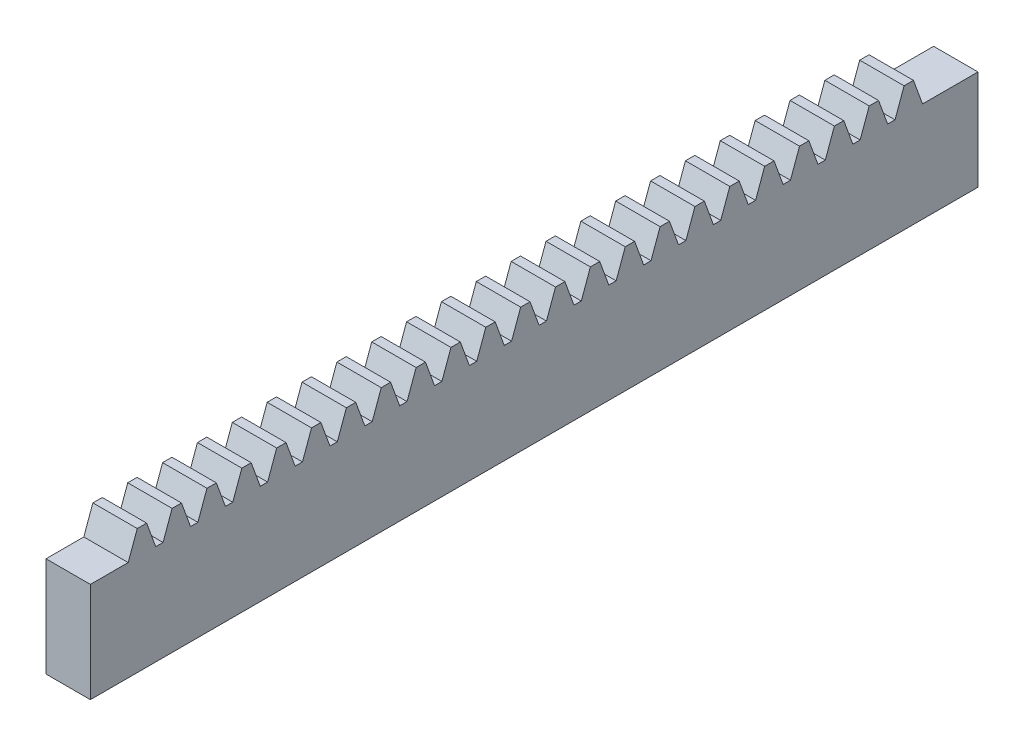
ISO-10303-21;
HEADER;
FILE_DESCRIPTION(('STEP AP214'),'2;1');
FILE_NAME('part.step','',(''),(''),'','','');
FILE_SCHEMA(('AUTOMOTIVE_DESIGN { 1 0 10303 214 1 1 1 1 }'));
ENDSEC;
DATA;
#1=APPLICATION_CONTEXT('core data for automotive mechanical design processes');
#2=APPLICATION_PROTOCOL_DEFINITION('international standard','automotive_design',2000,#1);
#3=PRODUCT_CONTEXT('',#1,'mechanical');
#4=PRODUCT('Part','Part','',(#3));
#5=PRODUCT_RELATED_PRODUCT_CATEGORY('part','',(#4));
#6=PRODUCT_DEFINITION_FORMATION('','',#4);
#7=PRODUCT_DEFINITION_CONTEXT('part definition',#1,'design');
#8=PRODUCT_DEFINITION('design','',#6,#7);
#9=PRODUCT_DEFINITION_SHAPE('','',#8);
#10=(LENGTH_UNIT() NAMED_UNIT(*) SI_UNIT(.MILLI.,.METRE.));
#11=(NAMED_UNIT(*) PLANE_ANGLE_UNIT() SI_UNIT($,.RADIAN.));
#12=(NAMED_UNIT(*) SI_UNIT($,.STERADIAN.) SOLID_ANGLE_UNIT());
#13=UNCERTAINTY_MEASURE_WITH_UNIT(LENGTH_MEASURE(1.E-05),#10,'distance_accuracy_value','');
#14=(GEOMETRIC_REPRESENTATION_CONTEXT(3) GLOBAL_UNCERTAINTY_ASSIGNED_CONTEXT((#13)) GLOBAL_UNIT_ASSIGNED_CONTEXT((#10,
#11,#12)) REPRESENTATION_CONTEXT('',''));
#15=CARTESIAN_POINT('',(0.,0.,0.));
#16=DIRECTION('',(0.,0.,1.));
#17=DIRECTION('',(1.,0.,0.));
#18=AXIS2_PLACEMENT_3D('',#15,#16,#17);
#19=CARTESIAN_POINT('',(8.,9.,-80.));
#20=DIRECTION('',(0.,-1.,0.));
#21=DIRECTION('',(0.,0.,-1.));
#22=AXIS2_PLACEMENT_3D('',#19,#20,#21);
#23=PLANE('',#22);
#24=DIRECTION('',(-1.,0.,0.));
#25=VECTOR('',#24,1.);
#26=CARTESIAN_POINT('',(8.,9.,-63.717));
#27=LINE('',#26,#25);
#28=CARTESIAN_POINT('',(8.,9.,-63.717));
#29=VERTEX_POINT('',#28);
#30=CARTESIAN_POINT('',(0.,9.,-63.717));
#31=VERTEX_POINT('',#30);
#32=EDGE_CURVE('E1374',#29,#31,#27,.T.);
#33=ORIENTED_EDGE('',*,*,#32,.F.);
#34=DIRECTION('',(0.,0.,1.));
#35=VECTOR('',#34,1.);
#36=CARTESIAN_POINT('',(8.,9.,-80.));
#37=LINE('',#36,#35);
#38=CARTESIAN_POINT('',(8.,9.,-65.04));
#39=VERTEX_POINT('',#38);
#40=EDGE_CURVE('E654',#39,#29,#37,.T.);
#41=ORIENTED_EDGE('',*,*,#40,.F.);
#42=DIRECTION('',(-1.,0.,0.));
#43=VECTOR('',#42,1.);
#44=CARTESIAN_POINT('',(8.,9.,-65.04));
#45=LINE('',#44,#43);
#46=CARTESIAN_POINT('',(0.,9.,-65.04));
#47=VERTEX_POINT('',#46);
#48=EDGE_CURVE('E1203',#39,#47,#45,.T.);
#49=ORIENTED_EDGE('',*,*,#48,.T.);
#50=DIRECTION('',(0.,0.,1.));
#51=VECTOR('',#50,1.);
#52=CARTESIAN_POINT('',(0.,9.,-80.));
#53=LINE('',#52,#51);
#54=EDGE_CURVE('E1230',#47,#31,#53,.T.);
#55=ORIENTED_EDGE('',*,*,#54,.T.);
#56=EDGE_LOOP('',(#33,#41,#49,#55));
#57=FACE_BOUND('',#56,.T.);
#58=ADVANCED_FACE('F41',(#57),#23,.F.);
#59=CARTESIAN_POINT('',(8.,9.,-58.757));
#60=VERTEX_POINT('',#59);
#61=CARTESIAN_POINT('',(8.,9.,-57.434));
#62=VERTEX_POINT('',#61);
#63=EDGE_CURVE('E1386',#60,#62,#37,.T.);
#64=ORIENTED_EDGE('',*,*,#63,.F.);
#65=DIRECTION('',(-1.,0.,0.));
#66=VECTOR('',#65,1.);
#67=CARTESIAN_POINT('',(8.,9.,-58.757));
#68=LINE('',#67,#66);
#69=CARTESIAN_POINT('',(0.,9.00000000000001,-58.757));
#70=VERTEX_POINT('',#69);
#71=EDGE_CURVE('E669',#60,#70,#68,.T.);
#72=ORIENTED_EDGE('',*,*,#71,.T.);
#73=CARTESIAN_POINT('',(0.,9.,-57.434));
#74=VERTEX_POINT('',#73);
#75=EDGE_CURVE('E1363',#70,#74,#53,.T.);
#76=ORIENTED_EDGE('',*,*,#75,.T.);
#77=DIRECTION('',(-1.,0.,0.));
#78=VECTOR('',#77,1.);
#79=CARTESIAN_POINT('',(8.,9.,-57.434));
#80=LINE('',#79,#78);
#81=EDGE_CURVE('E678',#62,#74,#80,.T.);
#82=ORIENTED_EDGE('',*,*,#81,.F.);
#83=EDGE_LOOP('',(#64,#72,#76,#82));
#84=FACE_BOUND('',#83,.T.);
#85=ADVANCED_FACE('F1390',(#84),#23,.F.);
#86=CARTESIAN_POINT('',(8.,9.,-52.474));
#87=VERTEX_POINT('',#86);
#88=CARTESIAN_POINT('',(8.,9.,-51.151));
#89=VERTEX_POINT('',#88);
#90=EDGE_CURVE('E1396',#87,#89,#37,.T.);
#91=ORIENTED_EDGE('',*,*,#90,.F.);
#92=DIRECTION('',(-1.,0.,0.));
#93=VECTOR('',#92,1.);
#94=CARTESIAN_POINT('',(8.,9.,-52.474));
#95=LINE('',#94,#93);
#96=CARTESIAN_POINT('',(0.,9.00000000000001,-52.474));
#97=VERTEX_POINT('',#96);
#98=EDGE_CURVE('E686',#87,#97,#95,.T.);
#99=ORIENTED_EDGE('',*,*,#98,.T.);
#100=CARTESIAN_POINT('',(0.,9.,-51.151));
#101=VERTEX_POINT('',#100);
#102=EDGE_CURVE('E1356',#97,#101,#53,.T.);
#103=ORIENTED_EDGE('',*,*,#102,.T.);
#104=DIRECTION('',(-1.,0.,0.));
#105=VECTOR('',#104,1.);
#106=CARTESIAN_POINT('',(8.,9.,-51.151));
#107=LINE('',#106,#105);
#108=EDGE_CURVE('E706',#89,#101,#107,.T.);
#109=ORIENTED_EDGE('',*,*,#108,.F.);
#110=EDGE_LOOP('',(#91,#99,#103,#109));
#111=FACE_BOUND('',#110,.T.);
#112=ADVANCED_FACE('F1482',(#111),#23,.F.);
#113=CARTESIAN_POINT('',(8.,9.,-46.191));
#114=VERTEX_POINT('',#113);
#115=CARTESIAN_POINT('',(8.,9.,-44.868));
#116=VERTEX_POINT('',#115);
#117=EDGE_CURVE('E1399',#114,#116,#37,.T.);
#118=ORIENTED_EDGE('',*,*,#117,.F.);
#119=DIRECTION('',(-1.,0.,0.));
#120=VECTOR('',#119,1.);
#121=CARTESIAN_POINT('',(8.,9.,-46.191));
#122=LINE('',#121,#120);
#123=CARTESIAN_POINT('',(0.,9.00000000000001,-46.191));
#124=VERTEX_POINT('',#123);
#125=EDGE_CURVE('E714',#114,#124,#122,.T.);
#126=ORIENTED_EDGE('',*,*,#125,.T.);
#127=CARTESIAN_POINT('',(0.,9.,-44.868));
#128=VERTEX_POINT('',#127);
#129=EDGE_CURVE('E1351',#124,#128,#53,.T.);
#130=ORIENTED_EDGE('',*,*,#129,.T.);
#131=DIRECTION('',(-1.,0.,0.));
#132=VECTOR('',#131,1.);
#133=CARTESIAN_POINT('',(8.,9.,-44.868));
#134=LINE('',#133,#132);
#135=EDGE_CURVE('E732',#116,#128,#134,.T.);
#136=ORIENTED_EDGE('',*,*,#135,.F.);
#137=EDGE_LOOP('',(#118,#126,#130,#136));
#138=FACE_BOUND('',#137,.T.);
#139=ADVANCED_FACE('F2245',(#138),#23,.F.);
#140=CARTESIAN_POINT('',(8.,9.,-39.908));
#141=VERTEX_POINT('',#140);
#142=CARTESIAN_POINT('',(8.,9.,-38.585));
#143=VERTEX_POINT('',#142);
#144=EDGE_CURVE('E1402',#141,#143,#37,.T.);
#145=ORIENTED_EDGE('',*,*,#144,.F.);
#146=DIRECTION('',(-1.,0.,0.));
#147=VECTOR('',#146,1.);
#148=CARTESIAN_POINT('',(8.,9.,-39.908));
#149=LINE('',#148,#147);
#150=CARTESIAN_POINT('',(0.,9.00000000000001,-39.908));
#151=VERTEX_POINT('',#150);
#152=EDGE_CURVE('E740',#141,#151,#149,.T.);
#153=ORIENTED_EDGE('',*,*,#152,.T.);
#154=CARTESIAN_POINT('',(0.,9.,-38.585));
#155=VERTEX_POINT('',#154);
#156=EDGE_CURVE('E1349',#151,#155,#53,.T.);
#157=ORIENTED_EDGE('',*,*,#156,.T.);
#158=DIRECTION('',(-1.,0.,0.));
#159=VECTOR('',#158,1.);
#160=CARTESIAN_POINT('',(8.,9.,-38.585));
#161=LINE('',#160,#159);
#162=EDGE_CURVE('E756',#143,#155,#161,.T.);
#163=ORIENTED_EDGE('',*,*,#162,.F.);
#164=EDGE_LOOP('',(#145,#153,#157,#163));
#165=FACE_BOUND('',#164,.T.);
#166=ADVANCED_FACE('F2249',(#165),#23,.F.);
#167=CARTESIAN_POINT('',(8.,9.,-33.625));
#168=VERTEX_POINT('',#167);
#169=CARTESIAN_POINT('',(8.,9.,-32.302));
#170=VERTEX_POINT('',#169);
#171=EDGE_CURVE('E1401',#168,#170,#37,.T.);
#172=ORIENTED_EDGE('',*,*,#171,.F.);
#173=DIRECTION('',(-1.,0.,0.));
#174=VECTOR('',#173,1.);
#175=CARTESIAN_POINT('',(8.,9.,-33.625));
#176=LINE('',#175,#174);
#177=CARTESIAN_POINT('',(0.,9.00000000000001,-33.625));
#178=VERTEX_POINT('',#177);
#179=EDGE_CURVE('E764',#168,#178,#176,.T.);
#180=ORIENTED_EDGE('',*,*,#179,.T.);
#181=CARTESIAN_POINT('',(0.,9.,-32.302));
#182=VERTEX_POINT('',#181);
#183=EDGE_CURVE('E1344',#178,#182,#53,.T.);
#184=ORIENTED_EDGE('',*,*,#183,.T.);
#185=DIRECTION('',(-1.,0.,0.));
#186=VECTOR('',#185,1.);
#187=CARTESIAN_POINT('',(8.,9.,-32.302));
#188=LINE('',#187,#186);
#189=EDGE_CURVE('E782',#170,#182,#188,.T.);
#190=ORIENTED_EDGE('',*,*,#189,.F.);
#191=EDGE_LOOP('',(#172,#180,#184,#190));
#192=FACE_BOUND('',#191,.T.);
#193=ADVANCED_FACE('F2259',(#192),#23,.F.);
#194=CARTESIAN_POINT('',(8.,9.,-27.342));
#195=VERTEX_POINT('',#194);
#196=CARTESIAN_POINT('',(8.,9.,-26.019));
#197=VERTEX_POINT('',#196);
#198=EDGE_CURVE('E1407',#195,#197,#37,.T.);
#199=ORIENTED_EDGE('',*,*,#198,.F.);
#200=DIRECTION('',(-1.,0.,0.));
#201=VECTOR('',#200,1.);
#202=CARTESIAN_POINT('',(8.,9.,-27.342));
#203=LINE('',#202,#201);
#204=CARTESIAN_POINT('',(0.,9.00000000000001,-27.342));
#205=VERTEX_POINT('',#204);
#206=EDGE_CURVE('E788',#195,#205,#203,.T.);
#207=ORIENTED_EDGE('',*,*,#206,.T.);
#208=CARTESIAN_POINT('',(0.,9.,-26.019));
#209=VERTEX_POINT('',#208);
#210=EDGE_CURVE('E1336',#205,#209,#53,.T.);
#211=ORIENTED_EDGE('',*,*,#210,.T.);
#212=DIRECTION('',(-1.,0.,0.));
#213=VECTOR('',#212,1.);
#214=CARTESIAN_POINT('',(8.,9.,-26.019));
#215=LINE('',#214,#213);
#216=EDGE_CURVE('E808',#197,#209,#215,.T.);
#217=ORIENTED_EDGE('',*,*,#216,.F.);
#218=EDGE_LOOP('',(#199,#207,#211,#217));
#219=FACE_BOUND('',#218,.T.);
#220=ADVANCED_FACE('F2267',(#219),#23,.F.);
#221=CARTESIAN_POINT('',(8.,9.,-21.059));
#222=VERTEX_POINT('',#221);
#223=CARTESIAN_POINT('',(8.,9.,-19.736));
#224=VERTEX_POINT('',#223);
#225=EDGE_CURVE('E1409',#222,#224,#37,.T.);
#226=ORIENTED_EDGE('',*,*,#225,.F.);
#227=DIRECTION('',(-1.,0.,0.));
#228=VECTOR('',#227,1.);
#229=CARTESIAN_POINT('',(8.,9.,-21.059));
#230=LINE('',#229,#228);
#231=CARTESIAN_POINT('',(0.,9.00000000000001,-21.059));
#232=VERTEX_POINT('',#231);
#233=EDGE_CURVE('E814',#222,#232,#230,.T.);
#234=ORIENTED_EDGE('',*,*,#233,.T.);
#235=CARTESIAN_POINT('',(0.,9.,-19.736));
#236=VERTEX_POINT('',#235);
#237=EDGE_CURVE('E1334',#232,#236,#53,.T.);
#238=ORIENTED_EDGE('',*,*,#237,.T.);
#239=DIRECTION('',(-1.,0.,0.));
#240=VECTOR('',#239,1.);
#241=CARTESIAN_POINT('',(8.,9.,-19.736));
#242=LINE('',#241,#240);
#243=EDGE_CURVE('E831',#224,#236,#242,.T.);
#244=ORIENTED_EDGE('',*,*,#243,.F.);
#245=EDGE_LOOP('',(#226,#234,#238,#244));
#246=FACE_BOUND('',#245,.T.);
#247=ADVANCED_FACE('F2274',(#246),#23,.F.);
#248=CARTESIAN_POINT('',(8.,9.,-14.776));
#249=VERTEX_POINT('',#248);
#250=CARTESIAN_POINT('',(8.,9.,-13.453));
#251=VERTEX_POINT('',#250);
#252=EDGE_CURVE('E1411',#249,#251,#37,.T.);
#253=ORIENTED_EDGE('',*,*,#252,.F.);
#254=DIRECTION('',(-1.,0.,0.));
#255=VECTOR('',#254,1.);
#256=CARTESIAN_POINT('',(8.,9.,-14.776));
#257=LINE('',#256,#255);
#258=CARTESIAN_POINT('',(0.,9.00000000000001,-14.776));
#259=VERTEX_POINT('',#258);
#260=EDGE_CURVE('E838',#249,#259,#257,.T.);
#261=ORIENTED_EDGE('',*,*,#260,.T.);
#262=CARTESIAN_POINT('',(0.,9.,-13.453));
#263=VERTEX_POINT('',#262);
#264=EDGE_CURVE('E1329',#259,#263,#53,.T.);
#265=ORIENTED_EDGE('',*,*,#264,.T.);
#266=DIRECTION('',(-1.,0.,0.));
#267=VECTOR('',#266,1.);
#268=CARTESIAN_POINT('',(8.,9.,-13.453));
#269=LINE('',#268,#267);
#270=EDGE_CURVE('E858',#251,#263,#269,.T.);
#271=ORIENTED_EDGE('',*,*,#270,.F.);
#272=EDGE_LOOP('',(#253,#261,#265,#271));
#273=FACE_BOUND('',#272,.T.);
#274=ADVANCED_FACE('F2285',(#273),#23,.F.);
#275=CARTESIAN_POINT('',(8.,9.,-8.49299999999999));
#276=VERTEX_POINT('',#275);
#277=CARTESIAN_POINT('',(8.,9.,-7.17));
#278=VERTEX_POINT('',#277);
#279=EDGE_CURVE('E1416',#276,#278,#37,.T.);
#280=ORIENTED_EDGE('',*,*,#279,.F.);
#281=DIRECTION('',(-1.,0.,0.));
#282=VECTOR('',#281,1.);
#283=CARTESIAN_POINT('',(8.,9.,-8.49299999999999));
#284=LINE('',#283,#282);
#285=CARTESIAN_POINT('',(0.,9.00000000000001,-8.493));
#286=VERTEX_POINT('',#285);
#287=EDGE_CURVE('E862',#276,#286,#284,.T.);
#288=ORIENTED_EDGE('',*,*,#287,.T.);
#289=CARTESIAN_POINT('',(0.,9.,-7.17));
#290=VERTEX_POINT('',#289);
#291=EDGE_CURVE('E1324',#286,#290,#53,.T.);
#292=ORIENTED_EDGE('',*,*,#291,.T.);
#293=DIRECTION('',(-1.,0.,0.));
#294=VECTOR('',#293,1.);
#295=CARTESIAN_POINT('',(8.,9.,-7.17));
#296=LINE('',#295,#294);
#297=EDGE_CURVE('E882',#278,#290,#296,.T.);
#298=ORIENTED_EDGE('',*,*,#297,.F.);
#299=EDGE_LOOP('',(#280,#288,#292,#298));
#300=FACE_BOUND('',#299,.T.);
#301=ADVANCED_FACE('F2289',(#300),#23,.F.);
#302=CARTESIAN_POINT('',(8.,9.,-2.20999999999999));
#303=VERTEX_POINT('',#302);
#304=CARTESIAN_POINT('',(8.,9.,-0.886999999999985));
#305=VERTEX_POINT('',#304);
#306=EDGE_CURVE('E1417',#303,#305,#37,.T.);
#307=ORIENTED_EDGE('',*,*,#306,.F.);
#308=DIRECTION('',(-1.,0.,0.));
#309=VECTOR('',#308,1.);
#310=CARTESIAN_POINT('',(8.,9.,-2.20999999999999));
#311=LINE('',#310,#309);
#312=CARTESIAN_POINT('',(0.,9.00000000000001,-2.21000000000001));
#313=VERTEX_POINT('',#312);
#314=EDGE_CURVE('E890',#303,#313,#311,.T.);
#315=ORIENTED_EDGE('',*,*,#314,.T.);
#316=CARTESIAN_POINT('',(0.,9.,-0.886999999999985));
#317=VERTEX_POINT('',#316);
#318=EDGE_CURVE('E1317',#313,#317,#53,.T.);
#319=ORIENTED_EDGE('',*,*,#318,.T.);
#320=DIRECTION('',(-1.,0.,0.));
#321=VECTOR('',#320,1.);
#322=CARTESIAN_POINT('',(8.,9.,-0.886999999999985));
#323=LINE('',#322,#321);
#324=EDGE_CURVE('E907',#305,#317,#323,.T.);
#325=ORIENTED_EDGE('',*,*,#324,.F.);
#326=EDGE_LOOP('',(#307,#315,#319,#325));
#327=FACE_BOUND('',#326,.T.);
#328=ADVANCED_FACE('F2298',(#327),#23,.F.);
#329=CARTESIAN_POINT('',(8.,9.,4.07300000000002));
#330=VERTEX_POINT('',#329);
#331=CARTESIAN_POINT('',(8.,9.,5.39600000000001));
#332=VERTEX_POINT('',#331);
#333=EDGE_CURVE('E1425',#330,#332,#37,.T.);
#334=ORIENTED_EDGE('',*,*,#333,.F.);
#335=DIRECTION('',(-1.,0.,0.));
#336=VECTOR('',#335,1.);
#337=CARTESIAN_POINT('',(8.,9.,4.07300000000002));
#338=LINE('',#337,#336);
#339=CARTESIAN_POINT('',(0.,9.00000000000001,4.07300000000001));
#340=VERTEX_POINT('',#339);
#341=EDGE_CURVE('E914',#330,#340,#338,.T.);
#342=ORIENTED_EDGE('',*,*,#341,.T.);
#343=CARTESIAN_POINT('',(0.,9.,5.39600000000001));
#344=VERTEX_POINT('',#343);
#345=EDGE_CURVE('E1313',#340,#344,#53,.T.);
#346=ORIENTED_EDGE('',*,*,#345,.T.);
#347=DIRECTION('',(-1.,0.,0.));
#348=VECTOR('',#347,1.);
#349=CARTESIAN_POINT('',(8.,9.,5.39600000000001));
#350=LINE('',#349,#348);
#351=EDGE_CURVE('E931',#332,#344,#350,.T.);
#352=ORIENTED_EDGE('',*,*,#351,.F.);
#353=EDGE_LOOP('',(#334,#342,#346,#352));
#354=FACE_BOUND('',#353,.T.);
#355=ADVANCED_FACE('F2306',(#354),#23,.F.);
#356=CARTESIAN_POINT('',(8.,9.,10.356));
#357=VERTEX_POINT('',#356);
#358=CARTESIAN_POINT('',(8.,9.,11.679));
#359=VERTEX_POINT('',#358);
#360=EDGE_CURVE('E1424',#357,#359,#37,.T.);
#361=ORIENTED_EDGE('',*,*,#360,.F.);
#362=DIRECTION('',(-1.,0.,0.));
#363=VECTOR('',#362,1.);
#364=CARTESIAN_POINT('',(8.,9.,10.356));
#365=LINE('',#364,#363);
#366=CARTESIAN_POINT('',(0.,9.00000000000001,10.356));
#367=VERTEX_POINT('',#366);
#368=EDGE_CURVE('E938',#357,#367,#365,.T.);
#369=ORIENTED_EDGE('',*,*,#368,.T.);
#370=CARTESIAN_POINT('',(0.,9.,11.679));
#371=VERTEX_POINT('',#370);
#372=EDGE_CURVE('E1308',#367,#371,#53,.T.);
#373=ORIENTED_EDGE('',*,*,#372,.T.);
#374=DIRECTION('',(-1.,0.,0.));
#375=VECTOR('',#374,1.);
#376=CARTESIAN_POINT('',(8.,9.,11.679));
#377=LINE('',#376,#375);
#378=EDGE_CURVE('E956',#359,#371,#377,.T.);
#379=ORIENTED_EDGE('',*,*,#378,.F.);
#380=EDGE_LOOP('',(#361,#369,#373,#379));
#381=FACE_BOUND('',#380,.T.);
#382=ADVANCED_FACE('F2311',(#381),#23,.F.);
#383=CARTESIAN_POINT('',(8.,9.,16.639));
#384=VERTEX_POINT('',#383);
#385=CARTESIAN_POINT('',(8.,9.,17.962));
#386=VERTEX_POINT('',#385);
#387=EDGE_CURVE('E1427',#384,#386,#37,.T.);
#388=ORIENTED_EDGE('',*,*,#387,.F.);
#389=DIRECTION('',(-1.,0.,0.));
#390=VECTOR('',#389,1.);
#391=CARTESIAN_POINT('',(8.,9.,16.639));
#392=LINE('',#391,#390);
#393=CARTESIAN_POINT('',(0.,9.00000000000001,16.639));
#394=VERTEX_POINT('',#393);
#395=EDGE_CURVE('E963',#384,#394,#392,.T.);
#396=ORIENTED_EDGE('',*,*,#395,.T.);
#397=CARTESIAN_POINT('',(0.,9.,17.962));
#398=VERTEX_POINT('',#397);
#399=EDGE_CURVE('E1301',#394,#398,#53,.T.);
#400=ORIENTED_EDGE('',*,*,#399,.T.);
#401=DIRECTION('',(-1.,0.,0.));
#402=VECTOR('',#401,1.);
#403=CARTESIAN_POINT('',(8.,9.,17.962));
#404=LINE('',#403,#402);
#405=EDGE_CURVE('E981',#386,#398,#404,.T.);
#406=ORIENTED_EDGE('',*,*,#405,.F.);
#407=EDGE_LOOP('',(#388,#396,#400,#406));
#408=FACE_BOUND('',#407,.T.);
#409=ADVANCED_FACE('F2325',(#408),#23,.F.);
#410=CARTESIAN_POINT('',(8.,9.,22.922));
#411=VERTEX_POINT('',#410);
#412=CARTESIAN_POINT('',(8.,9.,24.245));
#413=VERTEX_POINT('',#412);
#414=EDGE_CURVE('E1432',#411,#413,#37,.T.);
#415=ORIENTED_EDGE('',*,*,#414,.F.);
#416=DIRECTION('',(-1.,0.,0.));
#417=VECTOR('',#416,1.);
#418=CARTESIAN_POINT('',(8.,9.,22.922));
#419=LINE('',#418,#417);
#420=CARTESIAN_POINT('',(0.,9.00000000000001,22.922));
#421=VERTEX_POINT('',#420);
#422=EDGE_CURVE('E989',#411,#421,#419,.T.);
#423=ORIENTED_EDGE('',*,*,#422,.T.);
#424=CARTESIAN_POINT('',(0.,9.,24.245));
#425=VERTEX_POINT('',#424);
#426=EDGE_CURVE('E1296',#421,#425,#53,.T.);
#427=ORIENTED_EDGE('',*,*,#426,.T.);
#428=DIRECTION('',(-1.,0.,0.));
#429=VECTOR('',#428,1.);
#430=CARTESIAN_POINT('',(8.,9.,24.245));
#431=LINE('',#430,#429);
#432=EDGE_CURVE('E1007',#413,#425,#431,.T.);
#433=ORIENTED_EDGE('',*,*,#432,.F.);
#434=EDGE_LOOP('',(#415,#423,#427,#433));
#435=FACE_BOUND('',#434,.T.);
#436=ADVANCED_FACE('F2328',(#435),#23,.F.);
#437=CARTESIAN_POINT('',(8.,9.,29.205));
#438=VERTEX_POINT('',#437);
#439=CARTESIAN_POINT('',(8.,9.,30.528));
#440=VERTEX_POINT('',#439);
#441=EDGE_CURVE('E1431',#438,#440,#37,.T.);
#442=ORIENTED_EDGE('',*,*,#441,.F.);
#443=DIRECTION('',(-1.,0.,0.));
#444=VECTOR('',#443,1.);
#445=CARTESIAN_POINT('',(8.,9.,29.205));
#446=LINE('',#445,#444);
#447=CARTESIAN_POINT('',(0.,9.00000000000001,29.205));
#448=VERTEX_POINT('',#447);
#449=EDGE_CURVE('E1015',#438,#448,#446,.T.);
#450=ORIENTED_EDGE('',*,*,#449,.T.);
#451=CARTESIAN_POINT('',(0.,9.,30.528));
#452=VERTEX_POINT('',#451);
#453=EDGE_CURVE('E1294',#448,#452,#53,.T.);
#454=ORIENTED_EDGE('',*,*,#453,.T.);
#455=DIRECTION('',(-1.,0.,0.));
#456=VECTOR('',#455,1.);
#457=CARTESIAN_POINT('',(8.,9.,30.528));
#458=LINE('',#457,#456);
#459=EDGE_CURVE('E1031',#440,#452,#458,.T.);
#460=ORIENTED_EDGE('',*,*,#459,.F.);
#461=EDGE_LOOP('',(#442,#450,#454,#460));
#462=FACE_BOUND('',#461,.T.);
#463=ADVANCED_FACE('F2339',(#462),#23,.F.);
#464=CARTESIAN_POINT('',(8.,9.,35.488));
#465=VERTEX_POINT('',#464);
#466=CARTESIAN_POINT('',(8.,9.,36.811));
#467=VERTEX_POINT('',#466);
#468=EDGE_CURVE('E1437',#465,#467,#37,.T.);
#469=ORIENTED_EDGE('',*,*,#468,.F.);
#470=DIRECTION('',(-1.,0.,0.));
#471=VECTOR('',#470,1.);
#472=CARTESIAN_POINT('',(8.,9.,35.488));
#473=LINE('',#472,#471);
#474=CARTESIAN_POINT('',(0.,9.00000000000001,35.488));
#475=VERTEX_POINT('',#474);
#476=EDGE_CURVE('E1039',#465,#475,#473,.T.);
#477=ORIENTED_EDGE('',*,*,#476,.T.);
#478=CARTESIAN_POINT('',(0.,9.,36.811));
#479=VERTEX_POINT('',#478);
#480=EDGE_CURVE('E1289',#475,#479,#53,.T.);
#481=ORIENTED_EDGE('',*,*,#480,.T.);
#482=DIRECTION('',(-1.,0.,0.));
#483=VECTOR('',#482,1.);
#484=CARTESIAN_POINT('',(8.,9.,36.811));
#485=LINE('',#484,#483);
#486=EDGE_CURVE('E1057',#467,#479,#485,.T.);
#487=ORIENTED_EDGE('',*,*,#486,.F.);
#488=EDGE_LOOP('',(#469,#477,#481,#487));
#489=FACE_BOUND('',#488,.T.);
#490=ADVANCED_FACE('F2348',(#489),#23,.F.);
#491=CARTESIAN_POINT('',(8.,9.,41.771));
#492=VERTEX_POINT('',#491);
#493=CARTESIAN_POINT('',(8.,9.,43.094));
#494=VERTEX_POINT('',#493);
#495=EDGE_CURVE('E1440',#492,#494,#37,.T.);
#496=ORIENTED_EDGE('',*,*,#495,.F.);
#497=DIRECTION('',(-1.,0.,0.));
#498=VECTOR('',#497,1.);
#499=CARTESIAN_POINT('',(8.,9.,41.771));
#500=LINE('',#499,#498);
#501=CARTESIAN_POINT('',(0.,9.00000000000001,41.771));
#502=VERTEX_POINT('',#501);
#503=EDGE_CURVE('E1063',#492,#502,#500,.T.);
#504=ORIENTED_EDGE('',*,*,#503,.T.);
#505=CARTESIAN_POINT('',(0.,9.,43.094));
#506=VERTEX_POINT('',#505);
#507=EDGE_CURVE('E1281',#502,#506,#53,.T.);
#508=ORIENTED_EDGE('',*,*,#507,.T.);
#509=DIRECTION('',(-1.,0.,0.));
#510=VECTOR('',#509,1.);
#511=CARTESIAN_POINT('',(8.,9.,43.094));
#512=LINE('',#511,#510);
#513=EDGE_CURVE('E1083',#494,#506,#512,.T.);
#514=ORIENTED_EDGE('',*,*,#513,.F.);
#515=EDGE_LOOP('',(#496,#504,#508,#514));
#516=FACE_BOUND('',#515,.T.);
#517=ADVANCED_FACE('F2352',(#516),#23,.F.);
#518=CARTESIAN_POINT('',(8.,9.,48.054));
#519=VERTEX_POINT('',#518);
#520=CARTESIAN_POINT('',(8.,9.,49.377));
#521=VERTEX_POINT('',#520);
#522=EDGE_CURVE('E1444',#519,#521,#37,.T.);
#523=ORIENTED_EDGE('',*,*,#522,.F.);
#524=DIRECTION('',(-1.,0.,0.));
#525=VECTOR('',#524,1.);
#526=CARTESIAN_POINT('',(8.,9.,48.054));
#527=LINE('',#526,#525);
#528=CARTESIAN_POINT('',(0.,9.00000000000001,48.054));
#529=VERTEX_POINT('',#528);
#530=EDGE_CURVE('E1089',#519,#529,#527,.T.);
#531=ORIENTED_EDGE('',*,*,#530,.T.);
#532=CARTESIAN_POINT('',(0.,9.,49.377));
#533=VERTEX_POINT('',#532);
#534=EDGE_CURVE('E1279',#529,#533,#53,.T.);
#535=ORIENTED_EDGE('',*,*,#534,.T.);
#536=DIRECTION('',(-1.,0.,0.));
#537=VECTOR('',#536,1.);
#538=CARTESIAN_POINT('',(8.,9.,49.377));
#539=LINE('',#538,#537);
#540=EDGE_CURVE('E1106',#521,#533,#539,.T.);
#541=ORIENTED_EDGE('',*,*,#540,.F.);
#542=EDGE_LOOP('',(#523,#531,#535,#541));
#543=FACE_BOUND('',#542,.T.);
#544=ADVANCED_FACE('F1501',(#543),#23,.F.);
#545=CARTESIAN_POINT('',(8.,9.,54.337));
#546=VERTEX_POINT('',#545);
#547=CARTESIAN_POINT('',(8.,9.,55.66));
#548=VERTEX_POINT('',#547);
#549=EDGE_CURVE('E1447',#546,#548,#37,.T.);
#550=ORIENTED_EDGE('',*,*,#549,.F.);
#551=DIRECTION('',(-1.,0.,0.));
#552=VECTOR('',#551,1.);
#553=CARTESIAN_POINT('',(8.,9.,54.337));
#554=LINE('',#553,#552);
#555=CARTESIAN_POINT('',(0.,9.00000000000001,54.337));
#556=VERTEX_POINT('',#555);
#557=EDGE_CURVE('E1113',#546,#556,#554,.T.);
#558=ORIENTED_EDGE('',*,*,#557,.T.);
#559=CARTESIAN_POINT('',(0.,9.,55.66));
#560=VERTEX_POINT('',#559);
#561=EDGE_CURVE('E1274',#556,#560,#53,.T.);
#562=ORIENTED_EDGE('',*,*,#561,.T.);
#563=DIRECTION('',(-1.,0.,0.));
#564=VECTOR('',#563,1.);
#565=CARTESIAN_POINT('',(8.,9.,55.66));
#566=LINE('',#565,#564);
#567=EDGE_CURVE('E1133',#548,#560,#566,.T.);
#568=ORIENTED_EDGE('',*,*,#567,.F.);
#569=EDGE_LOOP('',(#550,#558,#562,#568));
#570=FACE_BOUND('',#569,.T.);
#571=ADVANCED_FACE('F1496',(#570),#23,.F.);
#572=CARTESIAN_POINT('',(8.,9.,60.62));
#573=VERTEX_POINT('',#572);
#574=CARTESIAN_POINT('',(8.,9.,61.943));
#575=VERTEX_POINT('',#574);
#576=EDGE_CURVE('E1449',#573,#575,#37,.T.);
#577=ORIENTED_EDGE('',*,*,#576,.F.);
#578=DIRECTION('',(-1.,0.,0.));
#579=VECTOR('',#578,1.);
#580=CARTESIAN_POINT('',(8.,9.,60.62));
#581=LINE('',#580,#579);
#582=CARTESIAN_POINT('',(0.,9.00000000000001,60.62));
#583=VERTEX_POINT('',#582);
#584=EDGE_CURVE('E1137',#573,#583,#581,.T.);
#585=ORIENTED_EDGE('',*,*,#584,.T.);
#586=CARTESIAN_POINT('',(0.,9.,61.943));
#587=VERTEX_POINT('',#586);
#588=EDGE_CURVE('E1269',#583,#587,#53,.T.);
#589=ORIENTED_EDGE('',*,*,#588,.T.);
#590=DIRECTION('',(-1.,0.,0.));
#591=VECTOR('',#590,1.);
#592=CARTESIAN_POINT('',(8.,9.,61.943));
#593=LINE('',#592,#591);
#594=EDGE_CURVE('E1154',#575,#587,#593,.T.);
#595=ORIENTED_EDGE('',*,*,#594,.F.);
#596=EDGE_LOOP('',(#577,#585,#589,#595));
#597=FACE_BOUND('',#596,.T.);
#598=ADVANCED_FACE('F1495',(#597),#23,.F.);
#599=CARTESIAN_POINT('',(8.,9.,66.903));
#600=VERTEX_POINT('',#599);
#601=CARTESIAN_POINT('',(8.,9.,68.226));
#602=VERTEX_POINT('',#601);
#603=EDGE_CURVE('E1452',#600,#602,#37,.T.);
#604=ORIENTED_EDGE('',*,*,#603,.F.);
#605=DIRECTION('',(-1.,0.,0.));
#606=VECTOR('',#605,1.);
#607=CARTESIAN_POINT('',(8.,9.,66.903));
#608=LINE('',#607,#606);
#609=CARTESIAN_POINT('',(0.,9.00000000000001,66.903));
#610=VERTEX_POINT('',#609);
#611=EDGE_CURVE('E1163',#600,#610,#608,.T.);
#612=ORIENTED_EDGE('',*,*,#611,.T.);
#613=CARTESIAN_POINT('',(0.,9.,68.226));
#614=VERTEX_POINT('',#613);
#615=EDGE_CURVE('E1267',#610,#614,#53,.T.);
#616=ORIENTED_EDGE('',*,*,#615,.T.);
#617=DIRECTION('',(-1.,0.,0.));
#618=VECTOR('',#617,1.);
#619=CARTESIAN_POINT('',(8.,9.,68.226));
#620=LINE('',#619,#618);
#621=EDGE_CURVE('E1177',#602,#614,#620,.T.);
#622=ORIENTED_EDGE('',*,*,#621,.F.);
#623=EDGE_LOOP('',(#604,#612,#616,#622));
#624=FACE_BOUND('',#623,.T.);
#625=ADVANCED_FACE('F1459',(#624),#23,.F.);
#626=DIRECTION('',(-1.,0.,0.));
#627=VECTOR('',#626,1.);
#628=CARTESIAN_POINT('',(8.,9.,-70.));
#629=LINE('',#628,#627);
#630=CARTESIAN_POINT('',(8.,9.,-70.));
#631=VERTEX_POINT('',#630);
#632=CARTESIAN_POINT('',(0.,9.,-70.));
#633=VERTEX_POINT('',#632);
#634=EDGE_CURVE('E1198',#631,#633,#629,.T.);
#635=ORIENTED_EDGE('',*,*,#634,.F.);
#636=CARTESIAN_POINT('',(8.,9.,-80.));
#637=VERTEX_POINT('',#636);
#638=EDGE_CURVE('E1214',#637,#631,#37,.T.);
#639=ORIENTED_EDGE('',*,*,#638,.F.);
#640=DIRECTION('',(-1.,0.,0.));
#641=VECTOR('',#640,1.);
#642=CARTESIAN_POINT('',(8.,9.,-80.));
#643=LINE('',#642,#641);
#644=CARTESIAN_POINT('',(0.,9.,-80.));
#645=VERTEX_POINT('',#644);
#646=EDGE_CURVE('E1225',#637,#645,#643,.T.);
#647=ORIENTED_EDGE('',*,*,#646,.T.);
#648=EDGE_CURVE('E1224',#645,#633,#53,.T.);
#649=ORIENTED_EDGE('',*,*,#648,.T.);
#650=EDGE_LOOP('',(#635,#639,#647,#649));
#651=FACE_BOUND('',#650,.T.);
#652=ADVANCED_FACE('F1259',(#651),#23,.F.);
#653=CARTESIAN_POINT('',(8.,9.,73.186));
#654=VERTEX_POINT('',#653);
#655=CARTESIAN_POINT('',(8.,9.,80.));
#656=VERTEX_POINT('',#655);
#657=EDGE_CURVE('E1216',#654,#656,#37,.T.);
#658=ORIENTED_EDGE('',*,*,#657,.F.);
#659=DIRECTION('',(-1.,0.,0.));
#660=VECTOR('',#659,1.);
#661=CARTESIAN_POINT('',(8.,9.,73.186));
#662=LINE('',#661,#660);
#663=CARTESIAN_POINT('',(0.,9.00000000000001,73.186));
#664=VERTEX_POINT('',#663);
#665=EDGE_CURVE('E1183',#654,#664,#662,.T.);
#666=ORIENTED_EDGE('',*,*,#665,.T.);
#667=CARTESIAN_POINT('',(0.,9.,80.));
#668=VERTEX_POINT('',#667);
#669=EDGE_CURVE('E1215',#664,#668,#53,.T.);
#670=ORIENTED_EDGE('',*,*,#669,.T.);
#671=DIRECTION('',(-1.,0.,0.));
#672=VECTOR('',#671,1.);
#673=CARTESIAN_POINT('',(8.,9.,80.));
#674=LINE('',#673,#672);
#675=EDGE_CURVE('E11',#656,#668,#674,.T.);
#676=ORIENTED_EDGE('',*,*,#675,.F.);
#677=EDGE_LOOP('',(#658,#666,#670,#676));
#678=FACE_BOUND('',#677,.T.);
#679=ADVANCED_FACE('F43',(#678),#23,.F.);
#680=CARTESIAN_POINT('',(8.,-9.,80.));
#681=DIRECTION('',(0.,0.,-1.));
#682=DIRECTION('',(-1.,0.,0.));
#683=AXIS2_PLACEMENT_3D('',#680,#681,#682);
#684=PLANE('',#683);
#685=DIRECTION('',(0.,-1.,0.));
#686=VECTOR('',#685,1.);
#687=CARTESIAN_POINT('',(0.,-9.,80.));
#688=LINE('',#687,#686);
#689=CARTESIAN_POINT('',(0.,-9.,80.));
#690=VERTEX_POINT('',#689);
#691=EDGE_CURVE('E1227',#668,#690,#688,.T.);
#692=ORIENTED_EDGE('',*,*,#691,.T.);
#693=DIRECTION('',(-1.,0.,0.));
#694=VECTOR('',#693,1.);
#695=CARTESIAN_POINT('',(8.,-9.,80.));
#696=LINE('',#695,#694);
#697=CARTESIAN_POINT('',(8.,-9.,80.));
#698=VERTEX_POINT('',#697);
#699=EDGE_CURVE('E47',#698,#690,#696,.T.);
#700=ORIENTED_EDGE('',*,*,#699,.F.);
#701=DIRECTION('',(0.,-1.,0.));
#702=VECTOR('',#701,1.);
#703=CARTESIAN_POINT('',(8.,-9.,80.));
#704=LINE('',#703,#702);
#705=EDGE_CURVE('E1213',#656,#698,#704,.T.);
#706=ORIENTED_EDGE('',*,*,#705,.F.);
#707=ORIENTED_EDGE('',*,*,#675,.T.);
#708=EDGE_LOOP('',(#692,#700,#706,#707));
#709=FACE_BOUND('',#708,.T.);
#710=ADVANCED_FACE('F1263',(#709),#684,.F.);
#711=CARTESIAN_POINT('',(8.,-9.,-80.));
#712=DIRECTION('',(0.,1.,0.));
#713=DIRECTION('',(0.,0.,1.));
#714=AXIS2_PLACEMENT_3D('',#711,#712,#713);
#715=PLANE('',#714);
#716=DIRECTION('',(0.,0.,-1.));
#717=VECTOR('',#716,1.);
#718=CARTESIAN_POINT('',(0.,-9.,-80.));
#719=LINE('',#718,#717);
#720=CARTESIAN_POINT('',(0.,-9.,-80.));
#721=VERTEX_POINT('',#720);
#722=EDGE_CURVE('E1229',#690,#721,#719,.T.);
#723=ORIENTED_EDGE('',*,*,#722,.T.);
#724=DIRECTION('',(-1.,0.,0.));
#725=VECTOR('',#724,1.);
#726=CARTESIAN_POINT('',(8.,-9.,-80.));
#727=LINE('',#726,#725);
#728=CARTESIAN_POINT('',(8.,-9.,-80.));
#729=VERTEX_POINT('',#728);
#730=EDGE_CURVE('E1235',#729,#721,#727,.T.);
#731=ORIENTED_EDGE('',*,*,#730,.F.);
#732=DIRECTION('',(0.,0.,-1.));
#733=VECTOR('',#732,1.);
#734=CARTESIAN_POINT('',(8.,-9.,-80.));
#735=LINE('',#734,#733);
#736=EDGE_CURVE('E1219',#698,#729,#735,.T.);
#737=ORIENTED_EDGE('',*,*,#736,.F.);
#738=ORIENTED_EDGE('',*,*,#699,.T.);
#739=EDGE_LOOP('',(#723,#731,#737,#738));
#740=FACE_BOUND('',#739,.T.);
#741=ADVANCED_FACE('F1242',(#740),#715,.F.);
#742=CARTESIAN_POINT('',(8.,-9.,-80.));
#743=DIRECTION('',(0.,0.,1.));
#744=DIRECTION('',(1.,0.,0.));
#745=AXIS2_PLACEMENT_3D('',#742,#743,#744);
#746=PLANE('',#745);
#747=DIRECTION('',(0.,1.,0.));
#748=VECTOR('',#747,1.);
#749=CARTESIAN_POINT('',(0.,-9.,-80.));
#750=LINE('',#749,#748);
#751=EDGE_CURVE('E1231',#721,#645,#750,.T.);
#752=ORIENTED_EDGE('',*,*,#751,.T.);
#753=ORIENTED_EDGE('',*,*,#646,.F.);
#754=DIRECTION('',(0.,1.,0.));
#755=VECTOR('',#754,1.);
#756=CARTESIAN_POINT('',(8.,-9.,-80.));
#757=LINE('',#756,#755);
#758=EDGE_CURVE('E1220',#729,#637,#757,.T.);
#759=ORIENTED_EDGE('',*,*,#758,.F.);
#760=ORIENTED_EDGE('',*,*,#730,.T.);
#761=EDGE_LOOP('',(#752,#753,#759,#760));
#762=FACE_BOUND('',#761,.T.);
#763=ADVANCED_FACE('F1254',(#762),#746,.F.);
#764=CARTESIAN_POINT('',(8.,0.,0.));
#765=DIRECTION('',(-1.,0.,0.));
#766=DIRECTION('',(0.,0.,1.));
#767=AXIS2_PLACEMENT_3D('',#764,#765,#766);
#768=PLANE('',#767);
#769=ORIENTED_EDGE('',*,*,#638,.T.);
#770=DIRECTION('',(0.,0.939884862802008,0.341491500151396));
#771=VECTOR('',#770,1.);
#772=CARTESIAN_POINT('',(8.,9.,-70.));
#773=LINE('',#772,#771);
#774=CARTESIAN_POINT('',(8.,13.5,-68.365));
#775=VERTEX_POINT('',#774);
#776=EDGE_CURVE('E1193',#631,#775,#773,.T.);
#777=ORIENTED_EDGE('',*,*,#776,.T.);
#778=DIRECTION('',(0.,0.,1.));
#779=VECTOR('',#778,1.);
#780=CARTESIAN_POINT('',(8.,13.5,-67.52));
#781=LINE('',#780,#779);
#782=CARTESIAN_POINT('',(8.,13.5,-66.675));
#783=VERTEX_POINT('',#782);
#784=EDGE_CURVE('E1194',#775,#783,#781,.T.);
#785=ORIENTED_EDGE('',*,*,#784,.T.);
#786=DIRECTION('',(0.,-0.939884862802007,0.341491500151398));
#787=VECTOR('',#786,1.);
#788=CARTESIAN_POINT('',(8.,9.,-65.04));
#789=LINE('',#788,#787);
#790=EDGE_CURVE('E1200',#783,#39,#789,.T.);
#791=ORIENTED_EDGE('',*,*,#790,.T.);
#792=ORIENTED_EDGE('',*,*,#40,.T.);
#793=DIRECTION('',(0.,0.939884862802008,0.341491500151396));
#794=VECTOR('',#793,1.);
#795=CARTESIAN_POINT('',(8.,9.,-63.717));
#796=LINE('',#795,#794);
#797=CARTESIAN_POINT('',(8.,13.5,-62.082));
#798=VERTEX_POINT('',#797);
#799=EDGE_CURVE('E647',#29,#798,#796,.T.);
#800=ORIENTED_EDGE('',*,*,#799,.T.);
#801=DIRECTION('',(0.,0.,1.));
#802=VECTOR('',#801,1.);
#803=CARTESIAN_POINT('',(8.,13.5,-61.237));
#804=LINE('',#803,#802);
#805=CARTESIAN_POINT('',(8.,13.5,-60.392));
#806=VERTEX_POINT('',#805);
#807=EDGE_CURVE('E636',#798,#806,#804,.T.);
#808=ORIENTED_EDGE('',*,*,#807,.T.);
#809=DIRECTION('',(0.,-0.939884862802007,0.341491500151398));
#810=VECTOR('',#809,1.);
#811=CARTESIAN_POINT('',(8.,9.,-58.757));
#812=LINE('',#811,#810);
#813=EDGE_CURVE('E648',#806,#60,#812,.T.);
#814=ORIENTED_EDGE('',*,*,#813,.T.);
#815=ORIENTED_EDGE('',*,*,#63,.T.);
#816=DIRECTION('',(0.,0.939884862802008,0.341491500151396));
#817=VECTOR('',#816,1.);
#818=CARTESIAN_POINT('',(8.,9.,-57.434));
#819=LINE('',#818,#817);
#820=CARTESIAN_POINT('',(8.,13.5,-55.799));
#821=VERTEX_POINT('',#820);
#822=EDGE_CURVE('E675',#62,#821,#819,.T.);
#823=ORIENTED_EDGE('',*,*,#822,.T.);
#824=DIRECTION('',(0.,0.,1.));
#825=VECTOR('',#824,1.);
#826=CARTESIAN_POINT('',(8.,13.5,-54.954));
#827=LINE('',#826,#825);
#828=CARTESIAN_POINT('',(8.,13.5,-54.109));
#829=VERTEX_POINT('',#828);
#830=EDGE_CURVE('E673',#821,#829,#827,.T.);
#831=ORIENTED_EDGE('',*,*,#830,.T.);
#832=DIRECTION('',(0.,-0.939884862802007,0.341491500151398));
#833=VECTOR('',#832,1.);
#834=CARTESIAN_POINT('',(8.,9.,-52.474));
#835=LINE('',#834,#833);
#836=EDGE_CURVE('E676',#829,#87,#835,.T.);
#837=ORIENTED_EDGE('',*,*,#836,.T.);
#838=ORIENTED_EDGE('',*,*,#90,.T.);
#839=DIRECTION('',(0.,0.939884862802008,0.341491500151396));
#840=VECTOR('',#839,1.);
#841=CARTESIAN_POINT('',(8.,9.,-51.151));
#842=LINE('',#841,#840);
#843=CARTESIAN_POINT('',(8.,13.5,-49.516));
#844=VERTEX_POINT('',#843);
#845=EDGE_CURVE('E696',#89,#844,#842,.T.);
#846=ORIENTED_EDGE('',*,*,#845,.T.);
#847=DIRECTION('',(0.,0.,1.));
#848=VECTOR('',#847,1.);
#849=CARTESIAN_POINT('',(8.,13.5,-48.671));
#850=LINE('',#849,#848);
#851=CARTESIAN_POINT('',(8.,13.5,-47.826));
#852=VERTEX_POINT('',#851);
#853=EDGE_CURVE('E701',#844,#852,#850,.T.);
#854=ORIENTED_EDGE('',*,*,#853,.T.);
#855=DIRECTION('',(0.,-0.939884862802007,0.341491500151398));
#856=VECTOR('',#855,1.);
#857=CARTESIAN_POINT('',(8.,9.,-46.191));
#858=LINE('',#857,#856);
#859=EDGE_CURVE('E702',#852,#114,#858,.T.);
#860=ORIENTED_EDGE('',*,*,#859,.T.);
#861=ORIENTED_EDGE('',*,*,#117,.T.);
#862=DIRECTION('',(0.,0.939884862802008,0.341491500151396));
#863=VECTOR('',#862,1.);
#864=CARTESIAN_POINT('',(8.,9.,-44.868));
#865=LINE('',#864,#863);
#866=CARTESIAN_POINT('',(8.,13.5,-43.233));
#867=VERTEX_POINT('',#866);
#868=EDGE_CURVE('E724',#116,#867,#865,.T.);
#869=ORIENTED_EDGE('',*,*,#868,.T.);
#870=DIRECTION('',(0.,0.,1.));
#871=VECTOR('',#870,1.);
#872=CARTESIAN_POINT('',(8.,13.5,-42.388));
#873=LINE('',#872,#871);
#874=CARTESIAN_POINT('',(8.,13.5,-41.543));
#875=VERTEX_POINT('',#874);
#876=EDGE_CURVE('E727',#867,#875,#873,.T.);
#877=ORIENTED_EDGE('',*,*,#876,.T.);
#878=DIRECTION('',(0.,-0.939884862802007,0.341491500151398));
#879=VECTOR('',#878,1.);
#880=CARTESIAN_POINT('',(8.,9.,-39.908));
#881=LINE('',#880,#879);
#882=EDGE_CURVE('E726',#875,#141,#881,.T.);
#883=ORIENTED_EDGE('',*,*,#882,.T.);
#884=ORIENTED_EDGE('',*,*,#144,.T.);
#885=DIRECTION('',(0.,0.939884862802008,0.341491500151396));
#886=VECTOR('',#885,1.);
#887=CARTESIAN_POINT('',(8.,9.,-38.585));
#888=LINE('',#887,#886);
#889=CARTESIAN_POINT('',(8.,13.5,-36.95));
#890=VERTEX_POINT('',#889);
#891=EDGE_CURVE('E746',#143,#890,#888,.T.);
#892=ORIENTED_EDGE('',*,*,#891,.T.);
#893=DIRECTION('',(0.,0.,1.));
#894=VECTOR('',#893,1.);
#895=CARTESIAN_POINT('',(8.,13.5,-36.105));
#896=LINE('',#895,#894);
#897=CARTESIAN_POINT('',(8.,13.5,-35.26));
#898=VERTEX_POINT('',#897);
#899=EDGE_CURVE('E753',#890,#898,#896,.T.);
#900=ORIENTED_EDGE('',*,*,#899,.T.);
#901=DIRECTION('',(0.,-0.939884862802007,0.341491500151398));
#902=VECTOR('',#901,1.);
#903=CARTESIAN_POINT('',(8.,9.,-33.625));
#904=LINE('',#903,#902);
#905=EDGE_CURVE('E754',#898,#168,#904,.T.);
#906=ORIENTED_EDGE('',*,*,#905,.T.);
#907=ORIENTED_EDGE('',*,*,#171,.T.);
#908=DIRECTION('',(0.,0.939884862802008,0.341491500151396));
#909=VECTOR('',#908,1.);
#910=CARTESIAN_POINT('',(8.,9.,-32.302));
#911=LINE('',#910,#909);
#912=CARTESIAN_POINT('',(8.,13.5,-30.667));
#913=VERTEX_POINT('',#912);
#914=EDGE_CURVE('E774',#170,#913,#911,.T.);
#915=ORIENTED_EDGE('',*,*,#914,.T.);
#916=DIRECTION('',(0.,0.,1.));
#917=VECTOR('',#916,1.);
#918=CARTESIAN_POINT('',(8.,13.5,-29.822));
#919=LINE('',#918,#917);
#920=CARTESIAN_POINT('',(8.,13.5,-28.977));
#921=VERTEX_POINT('',#920);
#922=EDGE_CURVE('E776',#913,#921,#919,.T.);
#923=ORIENTED_EDGE('',*,*,#922,.T.);
#924=DIRECTION('',(0.,-0.939884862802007,0.341491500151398));
#925=VECTOR('',#924,1.);
#926=CARTESIAN_POINT('',(8.,9.,-27.342));
#927=LINE('',#926,#925);
#928=EDGE_CURVE('E778',#921,#195,#927,.T.);
#929=ORIENTED_EDGE('',*,*,#928,.T.);
#930=ORIENTED_EDGE('',*,*,#198,.T.);
#931=DIRECTION('',(0.,0.939884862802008,0.341491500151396));
#932=VECTOR('',#931,1.);
#933=CARTESIAN_POINT('',(8.,9.,-26.019));
#934=LINE('',#933,#932);
#935=CARTESIAN_POINT('',(8.,13.5,-24.384));
#936=VERTEX_POINT('',#935);
#937=EDGE_CURVE('E799',#197,#936,#934,.T.);
#938=ORIENTED_EDGE('',*,*,#937,.T.);
#939=DIRECTION('',(0.,0.,1.));
#940=VECTOR('',#939,1.);
#941=CARTESIAN_POINT('',(8.,13.5,-23.539));
#942=LINE('',#941,#940);
#943=CARTESIAN_POINT('',(8.,13.5,-22.694));
#944=VERTEX_POINT('',#943);
#945=EDGE_CURVE('E803',#936,#944,#942,.T.);
#946=ORIENTED_EDGE('',*,*,#945,.T.);
#947=DIRECTION('',(0.,-0.939884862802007,0.341491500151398));
#948=VECTOR('',#947,1.);
#949=CARTESIAN_POINT('',(8.,9.,-21.059));
#950=LINE('',#949,#948);
#951=EDGE_CURVE('E805',#944,#222,#950,.T.);
#952=ORIENTED_EDGE('',*,*,#951,.T.);
#953=ORIENTED_EDGE('',*,*,#225,.T.);
#954=DIRECTION('',(0.,0.939884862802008,0.341491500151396));
#955=VECTOR('',#954,1.);
#956=CARTESIAN_POINT('',(8.,9.,-19.736));
#957=LINE('',#956,#955);
#958=CARTESIAN_POINT('',(8.,13.5,-18.101));
#959=VERTEX_POINT('',#958);
#960=EDGE_CURVE('E822',#224,#959,#957,.T.);
#961=ORIENTED_EDGE('',*,*,#960,.T.);
#962=DIRECTION('',(0.,0.,1.));
#963=VECTOR('',#962,1.);
#964=CARTESIAN_POINT('',(8.,13.5,-17.256));
#965=LINE('',#964,#963);
#966=CARTESIAN_POINT('',(8.,13.5,-16.411));
#967=VERTEX_POINT('',#966);
#968=EDGE_CURVE('E827',#959,#967,#965,.T.);
#969=ORIENTED_EDGE('',*,*,#968,.T.);
#970=DIRECTION('',(0.,-0.939884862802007,0.341491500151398));
#971=VECTOR('',#970,1.);
#972=CARTESIAN_POINT('',(8.,9.,-14.776));
#973=LINE('',#972,#971);
#974=EDGE_CURVE('E826',#967,#249,#973,.T.);
#975=ORIENTED_EDGE('',*,*,#974,.T.);
#976=ORIENTED_EDGE('',*,*,#252,.T.);
#977=DIRECTION('',(0.,0.939884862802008,0.341491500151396));
#978=VECTOR('',#977,1.);
#979=CARTESIAN_POINT('',(8.,9.,-13.453));
#980=LINE('',#979,#978);
#981=CARTESIAN_POINT('',(8.,13.5,-11.818));
#982=VERTEX_POINT('',#981);
#983=EDGE_CURVE('E849',#251,#982,#980,.T.);
#984=ORIENTED_EDGE('',*,*,#983,.T.);
#985=DIRECTION('',(0.,0.,1.));
#986=VECTOR('',#985,1.);
#987=CARTESIAN_POINT('',(8.,13.5,-10.973));
#988=LINE('',#987,#986);
#989=CARTESIAN_POINT('',(8.,13.5,-10.128));
#990=VERTEX_POINT('',#989);
#991=EDGE_CURVE('E852',#982,#990,#988,.T.);
#992=ORIENTED_EDGE('',*,*,#991,.T.);
#993=DIRECTION('',(0.,-0.939884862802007,0.341491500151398));
#994=VECTOR('',#993,1.);
#995=CARTESIAN_POINT('',(8.,9.,-8.49299999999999));
#996=LINE('',#995,#994);
#997=EDGE_CURVE('E851',#990,#276,#996,.T.);
#998=ORIENTED_EDGE('',*,*,#997,.T.);
#999=ORIENTED_EDGE('',*,*,#279,.T.);
#1000=DIRECTION('',(0.,0.939884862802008,0.341491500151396));
#1001=VECTOR('',#1000,1.);
#1002=CARTESIAN_POINT('',(8.,9.,-7.17));
#1003=LINE('',#1002,#1001);
#1004=CARTESIAN_POINT('',(8.,13.5,-5.535));
#1005=VERTEX_POINT('',#1004);
#1006=EDGE_CURVE('E873',#278,#1005,#1003,.T.);
#1007=ORIENTED_EDGE('',*,*,#1006,.T.);
#1008=DIRECTION('',(0.,0.,1.));
#1009=VECTOR('',#1008,1.);
#1010=CARTESIAN_POINT('',(8.,13.5,-4.69));
#1011=LINE('',#1010,#1009);
#1012=CARTESIAN_POINT('',(8.,13.5,-3.845));
#1013=VERTEX_POINT('',#1012);
#1014=EDGE_CURVE('E876',#1005,#1013,#1011,.T.);
#1015=ORIENTED_EDGE('',*,*,#1014,.T.);
#1016=DIRECTION('',(0.,-0.939884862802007,0.341491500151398));
#1017=VECTOR('',#1016,1.);
#1018=CARTESIAN_POINT('',(8.,9.,-2.20999999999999));
#1019=LINE('',#1018,#1017);
#1020=EDGE_CURVE('E878',#1013,#303,#1019,.T.);
#1021=ORIENTED_EDGE('',*,*,#1020,.T.);
#1022=ORIENTED_EDGE('',*,*,#306,.T.);
#1023=DIRECTION('',(0.,0.939884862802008,0.341491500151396));
#1024=VECTOR('',#1023,1.);
#1025=CARTESIAN_POINT('',(8.,9.,-0.886999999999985));
#1026=LINE('',#1025,#1024);
#1027=CARTESIAN_POINT('',(8.,13.5,0.748000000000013));
#1028=VERTEX_POINT('',#1027);
#1029=EDGE_CURVE('E896',#305,#1028,#1026,.T.);
#1030=ORIENTED_EDGE('',*,*,#1029,.T.);
#1031=DIRECTION('',(0.,0.,1.));
#1032=VECTOR('',#1031,1.);
#1033=CARTESIAN_POINT('',(8.,13.5,1.59300000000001));
#1034=LINE('',#1033,#1032);
#1035=CARTESIAN_POINT('',(8.,13.5,2.43800000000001));
#1036=VERTEX_POINT('',#1035);
#1037=EDGE_CURVE('E901',#1028,#1036,#1034,.T.);
#1038=ORIENTED_EDGE('',*,*,#1037,.T.);
#1039=DIRECTION('',(0.,-0.939884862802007,0.341491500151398));
#1040=VECTOR('',#1039,1.);
#1041=CARTESIAN_POINT('',(8.,9.,4.07300000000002));
#1042=LINE('',#1041,#1040);
#1043=EDGE_CURVE('E903',#1036,#330,#1042,.T.);
#1044=ORIENTED_EDGE('',*,*,#1043,.T.);
#1045=ORIENTED_EDGE('',*,*,#333,.T.);
#1046=DIRECTION('',(0.,0.939884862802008,0.341491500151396));
#1047=VECTOR('',#1046,1.);
#1048=CARTESIAN_POINT('',(8.,9.,5.39600000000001));
#1049=LINE('',#1048,#1047);
#1050=CARTESIAN_POINT('',(8.,13.5,7.03100000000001));
#1051=VERTEX_POINT('',#1050);
#1052=EDGE_CURVE('E923',#332,#1051,#1049,.T.);
#1053=ORIENTED_EDGE('',*,*,#1052,.T.);
#1054=DIRECTION('',(0.,0.,1.));
#1055=VECTOR('',#1054,1.);
#1056=CARTESIAN_POINT('',(8.,13.5,7.87600000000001));
#1057=LINE('',#1056,#1055);
#1058=CARTESIAN_POINT('',(8.,13.5,8.72100000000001));
#1059=VERTEX_POINT('',#1058);
#1060=EDGE_CURVE('E926',#1051,#1059,#1057,.T.);
#1061=ORIENTED_EDGE('',*,*,#1060,.T.);
#1062=DIRECTION('',(0.,-0.939884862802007,0.341491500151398));
#1063=VECTOR('',#1062,1.);
#1064=CARTESIAN_POINT('',(8.,9.,10.356));
#1065=LINE('',#1064,#1063);
#1066=EDGE_CURVE('E927',#1059,#357,#1065,.T.);
#1067=ORIENTED_EDGE('',*,*,#1066,.T.);
#1068=ORIENTED_EDGE('',*,*,#360,.T.);
#1069=DIRECTION('',(0.,0.939884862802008,0.341491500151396));
#1070=VECTOR('',#1069,1.);
#1071=CARTESIAN_POINT('',(8.,9.,11.679));
#1072=LINE('',#1071,#1070);
#1073=CARTESIAN_POINT('',(8.,13.5,13.314));
#1074=VERTEX_POINT('',#1073);
#1075=EDGE_CURVE('E949',#359,#1074,#1072,.T.);
#1076=ORIENTED_EDGE('',*,*,#1075,.T.);
#1077=DIRECTION('',(0.,0.,1.));
#1078=VECTOR('',#1077,1.);
#1079=CARTESIAN_POINT('',(8.,13.5,14.159));
#1080=LINE('',#1079,#1078);
#1081=CARTESIAN_POINT('',(8.,13.5,15.004));
#1082=VERTEX_POINT('',#1081);
#1083=EDGE_CURVE('E952',#1074,#1082,#1080,.T.);
#1084=ORIENTED_EDGE('',*,*,#1083,.T.);
#1085=DIRECTION('',(0.,-0.939884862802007,0.341491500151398));
#1086=VECTOR('',#1085,1.);
#1087=CARTESIAN_POINT('',(8.,9.,16.639));
#1088=LINE('',#1087,#1086);
#1089=EDGE_CURVE('E954',#1082,#384,#1088,.T.);
#1090=ORIENTED_EDGE('',*,*,#1089,.T.);
#1091=ORIENTED_EDGE('',*,*,#387,.T.);
#1092=DIRECTION('',(0.,0.939884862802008,0.341491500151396));
#1093=VECTOR('',#1092,1.);
#1094=CARTESIAN_POINT('',(8.,9.,17.962));
#1095=LINE('',#1094,#1093);
#1096=CARTESIAN_POINT('',(8.,13.5,19.597));
#1097=VERTEX_POINT('',#1096);
#1098=EDGE_CURVE('E971',#386,#1097,#1095,.T.);
#1099=ORIENTED_EDGE('',*,*,#1098,.T.);
#1100=DIRECTION('',(0.,0.,1.));
#1101=VECTOR('',#1100,1.);
#1102=CARTESIAN_POINT('',(8.,13.5,20.442));
#1103=LINE('',#1102,#1101);
#1104=CARTESIAN_POINT('',(8.,13.5,21.287));
#1105=VERTEX_POINT('',#1104);
#1106=EDGE_CURVE('E976',#1097,#1105,#1103,.T.);
#1107=ORIENTED_EDGE('',*,*,#1106,.T.);
#1108=DIRECTION('',(0.,-0.939884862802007,0.341491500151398));
#1109=VECTOR('',#1108,1.);
#1110=CARTESIAN_POINT('',(8.,9.,22.922));
#1111=LINE('',#1110,#1109);
#1112=EDGE_CURVE('E977',#1105,#411,#1111,.T.);
#1113=ORIENTED_EDGE('',*,*,#1112,.T.);
#1114=ORIENTED_EDGE('',*,*,#414,.T.);
#1115=DIRECTION('',(0.,0.939884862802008,0.341491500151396));
#1116=VECTOR('',#1115,1.);
#1117=CARTESIAN_POINT('',(8.,9.,24.245));
#1118=LINE('',#1117,#1116);
#1119=CARTESIAN_POINT('',(8.,13.5,25.88));
#1120=VERTEX_POINT('',#1119);
#1121=EDGE_CURVE('E999',#413,#1120,#1118,.T.);
#1122=ORIENTED_EDGE('',*,*,#1121,.T.);
#1123=DIRECTION('',(0.,0.,1.));
#1124=VECTOR('',#1123,1.);
#1125=CARTESIAN_POINT('',(8.,13.5,26.725));
#1126=LINE('',#1125,#1124);
#1127=CARTESIAN_POINT('',(8.,13.5,27.57));
#1128=VERTEX_POINT('',#1127);
#1129=EDGE_CURVE('E1002',#1120,#1128,#1126,.T.);
#1130=ORIENTED_EDGE('',*,*,#1129,.T.);
#1131=DIRECTION('',(0.,-0.939884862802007,0.341491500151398));
#1132=VECTOR('',#1131,1.);
#1133=CARTESIAN_POINT('',(8.,9.,29.205));
#1134=LINE('',#1133,#1132);
#1135=EDGE_CURVE('E1001',#1128,#438,#1134,.T.);
#1136=ORIENTED_EDGE('',*,*,#1135,.T.);
#1137=ORIENTED_EDGE('',*,*,#441,.T.);
#1138=DIRECTION('',(0.,0.939884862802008,0.341491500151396));
#1139=VECTOR('',#1138,1.);
#1140=CARTESIAN_POINT('',(8.,9.,30.528));
#1141=LINE('',#1140,#1139);
#1142=CARTESIAN_POINT('',(8.,13.5,32.163));
#1143=VERTEX_POINT('',#1142);
#1144=EDGE_CURVE('E1021',#440,#1143,#1141,.T.);
#1145=ORIENTED_EDGE('',*,*,#1144,.T.);
#1146=DIRECTION('',(0.,0.,1.));
#1147=VECTOR('',#1146,1.);
#1148=CARTESIAN_POINT('',(8.,13.5,33.008));
#1149=LINE('',#1148,#1147);
#1150=CARTESIAN_POINT('',(8.,13.5,33.853));
#1151=VERTEX_POINT('',#1150);
#1152=EDGE_CURVE('E1028',#1143,#1151,#1149,.T.);
#1153=ORIENTED_EDGE('',*,*,#1152,.T.);
#1154=DIRECTION('',(0.,-0.939884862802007,0.341491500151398));
#1155=VECTOR('',#1154,1.);
#1156=CARTESIAN_POINT('',(8.,9.,35.488));
#1157=LINE('',#1156,#1155);
#1158=EDGE_CURVE('E1029',#1151,#465,#1157,.T.);
#1159=ORIENTED_EDGE('',*,*,#1158,.T.);
#1160=ORIENTED_EDGE('',*,*,#468,.T.);
#1161=DIRECTION('',(0.,0.939884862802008,0.341491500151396));
#1162=VECTOR('',#1161,1.);
#1163=CARTESIAN_POINT('',(8.,9.,36.811));
#1164=LINE('',#1163,#1162);
#1165=CARTESIAN_POINT('',(8.,13.5,38.446));
#1166=VERTEX_POINT('',#1165);
#1167=EDGE_CURVE('E1049',#467,#1166,#1164,.T.);
#1168=ORIENTED_EDGE('',*,*,#1167,.T.);
#1169=DIRECTION('',(0.,0.,1.));
#1170=VECTOR('',#1169,1.);
#1171=CARTESIAN_POINT('',(8.,13.5,39.291));
#1172=LINE('',#1171,#1170);
#1173=CARTESIAN_POINT('',(8.,13.5,40.136));
#1174=VERTEX_POINT('',#1173);
#1175=EDGE_CURVE('E1051',#1166,#1174,#1172,.T.);
#1176=ORIENTED_EDGE('',*,*,#1175,.T.);
#1177=DIRECTION('',(0.,-0.939884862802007,0.341491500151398));
#1178=VECTOR('',#1177,1.);
#1179=CARTESIAN_POINT('',(8.,9.,41.771));
#1180=LINE('',#1179,#1178);
#1181=EDGE_CURVE('E1053',#1174,#492,#1180,.T.);
#1182=ORIENTED_EDGE('',*,*,#1181,.T.);
#1183=ORIENTED_EDGE('',*,*,#495,.T.);
#1184=DIRECTION('',(0.,0.939884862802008,0.341491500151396));
#1185=VECTOR('',#1184,1.);
#1186=CARTESIAN_POINT('',(8.,9.,43.094));
#1187=LINE('',#1186,#1185);
#1188=CARTESIAN_POINT('',(8.,13.5,44.729));
#1189=VERTEX_POINT('',#1188);
#1190=EDGE_CURVE('E1074',#494,#1189,#1187,.T.);
#1191=ORIENTED_EDGE('',*,*,#1190,.T.);
#1192=DIRECTION('',(0.,0.,1.));
#1193=VECTOR('',#1192,1.);
#1194=CARTESIAN_POINT('',(8.,13.5,45.574));
#1195=LINE('',#1194,#1193);
#1196=CARTESIAN_POINT('',(8.,13.5,46.419));
#1197=VERTEX_POINT('',#1196);
#1198=EDGE_CURVE('E1078',#1189,#1197,#1195,.T.);
#1199=ORIENTED_EDGE('',*,*,#1198,.T.);
#1200=DIRECTION('',(0.,-0.939884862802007,0.341491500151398));
#1201=VECTOR('',#1200,1.);
#1202=CARTESIAN_POINT('',(8.,9.,48.054));
#1203=LINE('',#1202,#1201);
#1204=EDGE_CURVE('E1080',#1197,#519,#1203,.T.);
#1205=ORIENTED_EDGE('',*,*,#1204,.T.);
#1206=ORIENTED_EDGE('',*,*,#522,.T.);
#1207=DIRECTION('',(0.,0.939884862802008,0.341491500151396));
#1208=VECTOR('',#1207,1.);
#1209=CARTESIAN_POINT('',(8.,9.,49.377));
#1210=LINE('',#1209,#1208);
#1211=CARTESIAN_POINT('',(8.,13.5,51.012));
#1212=VERTEX_POINT('',#1211);
#1213=EDGE_CURVE('E1097',#521,#1212,#1210,.T.);
#1214=ORIENTED_EDGE('',*,*,#1213,.T.);
#1215=DIRECTION('',(0.,0.,1.));
#1216=VECTOR('',#1215,1.);
#1217=CARTESIAN_POINT('',(8.,13.5,51.857));
#1218=LINE('',#1217,#1216);
#1219=CARTESIAN_POINT('',(8.,13.5,52.702));
#1220=VERTEX_POINT('',#1219);
#1221=EDGE_CURVE('E1102',#1212,#1220,#1218,.T.);
#1222=ORIENTED_EDGE('',*,*,#1221,.T.);
#1223=DIRECTION('',(0.,-0.939884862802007,0.341491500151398));
#1224=VECTOR('',#1223,1.);
#1225=CARTESIAN_POINT('',(8.,9.,54.337));
#1226=LINE('',#1225,#1224);
#1227=EDGE_CURVE('E1101',#1220,#546,#1226,.T.);
#1228=ORIENTED_EDGE('',*,*,#1227,.T.);
#1229=ORIENTED_EDGE('',*,*,#549,.T.);
#1230=DIRECTION('',(0.,0.939884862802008,0.341491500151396));
#1231=VECTOR('',#1230,1.);
#1232=CARTESIAN_POINT('',(8.,9.,55.66));
#1233=LINE('',#1232,#1231);
#1234=CARTESIAN_POINT('',(8.,13.5,57.295));
#1235=VERTEX_POINT('',#1234);
#1236=EDGE_CURVE('E1124',#548,#1235,#1233,.T.);
#1237=ORIENTED_EDGE('',*,*,#1236,.T.);
#1238=DIRECTION('',(0.,0.,1.));
#1239=VECTOR('',#1238,1.);
#1240=CARTESIAN_POINT('',(8.,13.5,58.14));
#1241=LINE('',#1240,#1239);
#1242=CARTESIAN_POINT('',(8.,13.5,58.985));
#1243=VERTEX_POINT('',#1242);
#1244=EDGE_CURVE('E1127',#1235,#1243,#1241,.T.);
#1245=ORIENTED_EDGE('',*,*,#1244,.T.);
#1246=DIRECTION('',(0.,-0.939884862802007,0.341491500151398));
#1247=VECTOR('',#1246,1.);
#1248=CARTESIAN_POINT('',(8.,9.,60.62));
#1249=LINE('',#1248,#1247);
#1250=EDGE_CURVE('E1126',#1243,#573,#1249,.T.);
#1251=ORIENTED_EDGE('',*,*,#1250,.T.);
#1252=ORIENTED_EDGE('',*,*,#576,.T.);
#1253=DIRECTION('',(0.,0.939884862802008,0.341491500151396));
#1254=VECTOR('',#1253,1.);
#1255=CARTESIAN_POINT('',(8.,9.,61.943));
#1256=LINE('',#1255,#1254);
#1257=CARTESIAN_POINT('',(8.,13.5,63.578));
#1258=VERTEX_POINT('',#1257);
#1259=EDGE_CURVE('E1148',#575,#1258,#1256,.T.);
#1260=ORIENTED_EDGE('',*,*,#1259,.T.);
#1261=DIRECTION('',(0.,0.,1.));
#1262=VECTOR('',#1261,1.);
#1263=CARTESIAN_POINT('',(8.,13.5,64.423));
#1264=LINE('',#1263,#1262);
#1265=CARTESIAN_POINT('',(8.,13.5,65.268));
#1266=VERTEX_POINT('',#1265);
#1267=EDGE_CURVE('E1151',#1258,#1266,#1264,.T.);
#1268=ORIENTED_EDGE('',*,*,#1267,.T.);
#1269=DIRECTION('',(0.,-0.939884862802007,0.341491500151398));
#1270=VECTOR('',#1269,1.);
#1271=CARTESIAN_POINT('',(8.,9.,66.903));
#1272=LINE('',#1271,#1270);
#1273=EDGE_CURVE('E1152',#1266,#600,#1272,.T.);
#1274=ORIENTED_EDGE('',*,*,#1273,.T.);
#1275=ORIENTED_EDGE('',*,*,#603,.T.);
#1276=DIRECTION('',(0.,0.939884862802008,0.341491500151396));
#1277=VECTOR('',#1276,1.);
#1278=CARTESIAN_POINT('',(8.,9.,68.226));
#1279=LINE('',#1278,#1277);
#1280=CARTESIAN_POINT('',(8.,13.5,69.861));
#1281=VERTEX_POINT('',#1280);
#1282=EDGE_CURVE('E1168',#602,#1281,#1279,.T.);
#1283=ORIENTED_EDGE('',*,*,#1282,.T.);
#1284=DIRECTION('',(0.,0.,1.));
#1285=VECTOR('',#1284,1.);
#1286=CARTESIAN_POINT('',(8.,13.5,70.706));
#1287=LINE('',#1286,#1285);
#1288=CARTESIAN_POINT('',(8.,13.5,71.551));
#1289=VERTEX_POINT('',#1288);
#1290=EDGE_CURVE('E1171',#1281,#1289,#1287,.T.);
#1291=ORIENTED_EDGE('',*,*,#1290,.T.);
#1292=DIRECTION('',(0.,-0.939884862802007,0.341491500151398));
#1293=VECTOR('',#1292,1.);
#1294=CARTESIAN_POINT('',(8.,9.,73.186));
#1295=LINE('',#1294,#1293);
#1296=EDGE_CURVE('E1173',#1289,#654,#1295,.T.);
#1297=ORIENTED_EDGE('',*,*,#1296,.T.);
#1298=ORIENTED_EDGE('',*,*,#657,.T.);
#1299=ORIENTED_EDGE('',*,*,#705,.T.);
#1300=ORIENTED_EDGE('',*,*,#736,.T.);
#1301=ORIENTED_EDGE('',*,*,#758,.T.);
#1302=EDGE_LOOP('',(#769,#777,#785,#791,#792,#800,#808,#814,#815,#823,#831,#837,#838,#846,#854,
#860,#861,#869,#877,#883,#884,#892,#900,#906,#907,#915,#923,#929,#930,#938,#946,#952,#953,#961,
#969,#975,#976,#984,#992,#998,#999,#1007,#1015,#1021,#1022,#1030,#1038,#1044,#1045,#1053,#1061,
#1067,#1068,#1076,#1084,#1090,#1091,#1099,#1107,#1113,#1114,#1122,#1130,#1136,#1137,#1145,#1153,
#1159,#1160,#1168,#1176,#1182,#1183,#1191,#1199,#1205,#1206,#1214,#1222,#1228,#1229,#1237,#1245,
#1251,#1252,#1260,#1268,#1274,#1275,#1283,#1291,#1297,#1298,#1299,#1300,#1301));
#1303=FACE_BOUND('',#1302,.T.);
#1304=ADVANCED_FACE('F653',(#1303),#768,.F.);
#1305=CARTESIAN_POINT('',(0.,0.,0.));
#1306=DIRECTION('',(-1.,0.,0.));
#1307=DIRECTION('',(0.,0.,1.));
#1308=AXIS2_PLACEMENT_3D('',#1305,#1306,#1307);
#1309=PLANE('',#1308);
#1310=ORIENTED_EDGE('',*,*,#648,.F.);
#1311=ORIENTED_EDGE('',*,*,#751,.F.);
#1312=ORIENTED_EDGE('',*,*,#722,.F.);
#1313=ORIENTED_EDGE('',*,*,#691,.F.);
#1314=ORIENTED_EDGE('',*,*,#669,.F.);
#1315=DIRECTION('',(0.,-0.939884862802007,0.341491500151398));
#1316=VECTOR('',#1315,1.);
#1317=CARTESIAN_POINT('',(0.,9.,73.186));
#1318=LINE('',#1317,#1316);
#1319=CARTESIAN_POINT('',(0.,13.5,71.551));
#1320=VERTEX_POINT('',#1319);
#1321=EDGE_CURVE('E57',#1320,#664,#1318,.T.);
#1322=ORIENTED_EDGE('',*,*,#1321,.F.);
#1323=DIRECTION('',(0.,0.,1.));
#1324=VECTOR('',#1323,1.);
#1325=CARTESIAN_POINT('',(0.,13.5,70.706));
#1326=LINE('',#1325,#1324);
#1327=CARTESIAN_POINT('',(0.,13.5,69.861));
#1328=VERTEX_POINT('',#1327);
#1329=EDGE_CURVE('E1182',#1328,#1320,#1326,.T.);
#1330=ORIENTED_EDGE('',*,*,#1329,.F.);
#1331=DIRECTION('',(0.,0.939884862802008,0.341491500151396));
#1332=VECTOR('',#1331,1.);
#1333=CARTESIAN_POINT('',(0.,9.,68.226));
#1334=LINE('',#1333,#1332);
#1335=EDGE_CURVE('E1179',#614,#1328,#1334,.T.);
#1336=ORIENTED_EDGE('',*,*,#1335,.F.);
#1337=ORIENTED_EDGE('',*,*,#615,.F.);
#1338=DIRECTION('',(0.,-0.939884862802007,0.341491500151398));
#1339=VECTOR('',#1338,1.);
#1340=CARTESIAN_POINT('',(0.,9.,66.903));
#1341=LINE('',#1340,#1339);
#1342=CARTESIAN_POINT('',(0.,13.5,65.268));
#1343=VERTEX_POINT('',#1342);
#1344=EDGE_CURVE('E63',#1343,#610,#1341,.T.);
#1345=ORIENTED_EDGE('',*,*,#1344,.F.);
#1346=DIRECTION('',(0.,0.,1.));
#1347=VECTOR('',#1346,1.);
#1348=CARTESIAN_POINT('',(0.,13.5,64.423));
#1349=LINE('',#1348,#1347);
#1350=CARTESIAN_POINT('',(0.,13.5,63.578));
#1351=VERTEX_POINT('',#1350);
#1352=EDGE_CURVE('E1156',#1351,#1343,#1349,.T.);
#1353=ORIENTED_EDGE('',*,*,#1352,.F.);
#1354=DIRECTION('',(0.,0.939884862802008,0.341491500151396));
#1355=VECTOR('',#1354,1.);
#1356=CARTESIAN_POINT('',(0.,9.,61.943));
#1357=LINE('',#1356,#1355);
#1358=EDGE_CURVE('E1157',#587,#1351,#1357,.T.);
#1359=ORIENTED_EDGE('',*,*,#1358,.F.);
#1360=ORIENTED_EDGE('',*,*,#588,.F.);
#1361=DIRECTION('',(0.,-0.939884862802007,0.341491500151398));
#1362=VECTOR('',#1361,1.);
#1363=CARTESIAN_POINT('',(0.,9.,60.62));
#1364=LINE('',#1363,#1362);
#1365=CARTESIAN_POINT('',(0.,13.5,58.985));
#1366=VERTEX_POINT('',#1365);
#1367=EDGE_CURVE('E1130',#1366,#583,#1364,.T.);
#1368=ORIENTED_EDGE('',*,*,#1367,.F.);
#1369=DIRECTION('',(0.,0.,1.));
#1370=VECTOR('',#1369,1.);
#1371=CARTESIAN_POINT('',(0.,13.5,58.14));
#1372=LINE('',#1371,#1370);
#1373=CARTESIAN_POINT('',(0.,13.5,57.295));
#1374=VERTEX_POINT('',#1373);
#1375=EDGE_CURVE('E1134',#1374,#1366,#1372,.T.);
#1376=ORIENTED_EDGE('',*,*,#1375,.F.);
#1377=DIRECTION('',(0.,0.939884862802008,0.341491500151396));
#1378=VECTOR('',#1377,1.);
#1379=CARTESIAN_POINT('',(0.,9.,55.66));
#1380=LINE('',#1379,#1378);
#1381=EDGE_CURVE('E1132',#560,#1374,#1380,.T.);
#1382=ORIENTED_EDGE('',*,*,#1381,.F.);
#1383=ORIENTED_EDGE('',*,*,#561,.F.);
#1384=DIRECTION('',(0.,-0.939884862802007,0.341491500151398));
#1385=VECTOR('',#1384,1.);
#1386=CARTESIAN_POINT('',(0.,9.,54.337));
#1387=LINE('',#1386,#1385);
#1388=CARTESIAN_POINT('',(0.,13.5,52.702));
#1389=VERTEX_POINT('',#1388);
#1390=EDGE_CURVE('E1105',#1389,#556,#1387,.T.);
#1391=ORIENTED_EDGE('',*,*,#1390,.F.);
#1392=DIRECTION('',(0.,0.,1.));
#1393=VECTOR('',#1392,1.);
#1394=CARTESIAN_POINT('',(0.,13.5,51.857));
#1395=LINE('',#1394,#1393);
#1396=CARTESIAN_POINT('',(0.,13.5,51.012));
#1397=VERTEX_POINT('',#1396);
#1398=EDGE_CURVE('E1110',#1397,#1389,#1395,.T.);
#1399=ORIENTED_EDGE('',*,*,#1398,.F.);
#1400=DIRECTION('',(0.,0.939884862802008,0.341491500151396));
#1401=VECTOR('',#1400,1.);
#1402=CARTESIAN_POINT('',(0.,9.,49.377));
#1403=LINE('',#1402,#1401);
#1404=EDGE_CURVE('E1107',#533,#1397,#1403,.T.);
#1405=ORIENTED_EDGE('',*,*,#1404,.F.);
#1406=ORIENTED_EDGE('',*,*,#534,.F.);
#1407=DIRECTION('',(0.,-0.939884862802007,0.341491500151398));
#1408=VECTOR('',#1407,1.);
#1409=CARTESIAN_POINT('',(0.,9.,48.054));
#1410=LINE('',#1409,#1408);
#1411=CARTESIAN_POINT('',(0.,13.5,46.419));
#1412=VERTEX_POINT('',#1411);
#1413=EDGE_CURVE('E1077',#1412,#529,#1410,.T.);
#1414=ORIENTED_EDGE('',*,*,#1413,.F.);
#1415=DIRECTION('',(0.,0.,1.));
#1416=VECTOR('',#1415,1.);
#1417=CARTESIAN_POINT('',(0.,13.5,45.574));
#1418=LINE('',#1417,#1416);
#1419=CARTESIAN_POINT('',(0.,13.5,44.729));
#1420=VERTEX_POINT('',#1419);
#1421=EDGE_CURVE('E1082',#1420,#1412,#1418,.T.);
#1422=ORIENTED_EDGE('',*,*,#1421,.F.);
#1423=DIRECTION('',(0.,0.939884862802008,0.341491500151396));
#1424=VECTOR('',#1423,1.);
#1425=CARTESIAN_POINT('',(0.,9.,43.094));
#1426=LINE('',#1425,#1424);
#1427=EDGE_CURVE('E1085',#506,#1420,#1426,.T.);
#1428=ORIENTED_EDGE('',*,*,#1427,.F.);
#1429=ORIENTED_EDGE('',*,*,#507,.F.);
#1430=DIRECTION('',(0.,-0.939884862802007,0.341491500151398));
#1431=VECTOR('',#1430,1.);
#1432=CARTESIAN_POINT('',(0.,9.,41.771));
#1433=LINE('',#1432,#1431);
#1434=CARTESIAN_POINT('',(0.,13.5,40.136));
#1435=VERTEX_POINT('',#1434);
#1436=EDGE_CURVE('E1052',#1435,#502,#1433,.T.);
#1437=ORIENTED_EDGE('',*,*,#1436,.F.);
#1438=DIRECTION('',(0.,0.,1.));
#1439=VECTOR('',#1438,1.);
#1440=CARTESIAN_POINT('',(0.,13.5,39.291));
#1441=LINE('',#1440,#1439);
#1442=CARTESIAN_POINT('',(0.,13.5,38.446));
#1443=VERTEX_POINT('',#1442);
#1444=EDGE_CURVE('E1058',#1443,#1435,#1441,.T.);
#1445=ORIENTED_EDGE('',*,*,#1444,.F.);
#1446=DIRECTION('',(0.,0.939884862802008,0.341491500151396));
#1447=VECTOR('',#1446,1.);
#1448=CARTESIAN_POINT('',(0.,9.,36.811));
#1449=LINE('',#1448,#1447);
#1450=EDGE_CURVE('E1060',#479,#1443,#1449,.T.);
#1451=ORIENTED_EDGE('',*,*,#1450,.F.);
#1452=ORIENTED_EDGE('',*,*,#480,.F.);
#1453=DIRECTION('',(0.,-0.939884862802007,0.341491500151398));
#1454=VECTOR('',#1453,1.);
#1455=CARTESIAN_POINT('',(0.,9.,35.488));
#1456=LINE('',#1455,#1454);
#1457=CARTESIAN_POINT('',(0.,13.5,33.853));
#1458=VERTEX_POINT('',#1457);
#1459=EDGE_CURVE('E1030',#1458,#475,#1456,.T.);
#1460=ORIENTED_EDGE('',*,*,#1459,.F.);
#1461=DIRECTION('',(0.,0.,1.));
#1462=VECTOR('',#1461,1.);
#1463=CARTESIAN_POINT('',(0.,13.5,33.008));
#1464=LINE('',#1463,#1462);
#1465=CARTESIAN_POINT('',(0.,13.5,32.163));
#1466=VERTEX_POINT('',#1465);
#1467=EDGE_CURVE('E1034',#1466,#1458,#1464,.T.);
#1468=ORIENTED_EDGE('',*,*,#1467,.F.);
#1469=DIRECTION('',(0.,0.939884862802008,0.341491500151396));
#1470=VECTOR('',#1469,1.);
#1471=CARTESIAN_POINT('',(0.,9.,30.528));
#1472=LINE('',#1471,#1470);
#1473=EDGE_CURVE('E1035',#452,#1466,#1472,.T.);
#1474=ORIENTED_EDGE('',*,*,#1473,.F.);
#1475=ORIENTED_EDGE('',*,*,#453,.F.);
#1476=DIRECTION('',(0.,-0.939884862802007,0.341491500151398));
#1477=VECTOR('',#1476,1.);
#1478=CARTESIAN_POINT('',(0.,9.,29.205));
#1479=LINE('',#1478,#1477);
#1480=CARTESIAN_POINT('',(0.,13.5,27.57));
#1481=VERTEX_POINT('',#1480);
#1482=EDGE_CURVE('E1005',#1481,#448,#1479,.T.);
#1483=ORIENTED_EDGE('',*,*,#1482,.F.);
#1484=DIRECTION('',(0.,0.,1.));
#1485=VECTOR('',#1484,1.);
#1486=CARTESIAN_POINT('',(0.,13.5,26.725));
#1487=LINE('',#1486,#1485);
#1488=CARTESIAN_POINT('',(0.,13.5,25.88));
#1489=VERTEX_POINT('',#1488);
#1490=EDGE_CURVE('E1008',#1489,#1481,#1487,.T.);
#1491=ORIENTED_EDGE('',*,*,#1490,.F.);
#1492=DIRECTION('',(0.,0.939884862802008,0.341491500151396));
#1493=VECTOR('',#1492,1.);
#1494=CARTESIAN_POINT('',(0.,9.,24.245));
#1495=LINE('',#1494,#1493);
#1496=EDGE_CURVE('E1010',#425,#1489,#1495,.T.);
#1497=ORIENTED_EDGE('',*,*,#1496,.F.);
#1498=ORIENTED_EDGE('',*,*,#426,.F.);
#1499=DIRECTION('',(0.,-0.939884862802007,0.341491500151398));
#1500=VECTOR('',#1499,1.);
#1501=CARTESIAN_POINT('',(0.,9.,22.922));
#1502=LINE('',#1501,#1500);
#1503=CARTESIAN_POINT('',(0.,13.5,21.287));
#1504=VERTEX_POINT('',#1503);
#1505=EDGE_CURVE('E980',#1504,#421,#1502,.T.);
#1506=ORIENTED_EDGE('',*,*,#1505,.F.);
#1507=DIRECTION('',(0.,0.,1.));
#1508=VECTOR('',#1507,1.);
#1509=CARTESIAN_POINT('',(0.,13.5,20.442));
#1510=LINE('',#1509,#1508);
#1511=CARTESIAN_POINT('',(0.,13.5,19.597));
#1512=VERTEX_POINT('',#1511);
#1513=EDGE_CURVE('E984',#1512,#1504,#1510,.T.);
#1514=ORIENTED_EDGE('',*,*,#1513,.F.);
#1515=DIRECTION('',(0.,0.939884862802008,0.341491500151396));
#1516=VECTOR('',#1515,1.);
#1517=CARTESIAN_POINT('',(0.,9.,17.962));
#1518=LINE('',#1517,#1516);
#1519=EDGE_CURVE('E985',#398,#1512,#1518,.T.);
#1520=ORIENTED_EDGE('',*,*,#1519,.F.);
#1521=ORIENTED_EDGE('',*,*,#399,.F.);
#1522=DIRECTION('',(0.,-0.939884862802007,0.341491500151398));
#1523=VECTOR('',#1522,1.);
#1524=CARTESIAN_POINT('',(0.,9.,16.639));
#1525=LINE('',#1524,#1523);
#1526=CARTESIAN_POINT('',(0.,13.5,15.004));
#1527=VERTEX_POINT('',#1526);
#1528=EDGE_CURVE('E955',#1527,#394,#1525,.T.);
#1529=ORIENTED_EDGE('',*,*,#1528,.F.);
#1530=DIRECTION('',(0.,0.,1.));
#1531=VECTOR('',#1530,1.);
#1532=CARTESIAN_POINT('',(0.,13.5,14.159));
#1533=LINE('',#1532,#1531);
#1534=CARTESIAN_POINT('',(0.,13.5,13.314));
#1535=VERTEX_POINT('',#1534);
#1536=EDGE_CURVE('E960',#1535,#1527,#1533,.T.);
#1537=ORIENTED_EDGE('',*,*,#1536,.F.);
#1538=DIRECTION('',(0.,0.939884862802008,0.341491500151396));
#1539=VECTOR('',#1538,1.);
#1540=CARTESIAN_POINT('',(0.,9.,11.679));
#1541=LINE('',#1540,#1539);
#1542=EDGE_CURVE('E957',#371,#1535,#1541,.T.);
#1543=ORIENTED_EDGE('',*,*,#1542,.F.);
#1544=ORIENTED_EDGE('',*,*,#372,.F.);
#1545=DIRECTION('',(0.,-0.939884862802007,0.341491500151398));
#1546=VECTOR('',#1545,1.);
#1547=CARTESIAN_POINT('',(0.,9.,10.356));
#1548=LINE('',#1547,#1546);
#1549=CARTESIAN_POINT('',(0.,13.5,8.72100000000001));
#1550=VERTEX_POINT('',#1549);
#1551=EDGE_CURVE('E930',#1550,#367,#1548,.T.);
#1552=ORIENTED_EDGE('',*,*,#1551,.F.);
#1553=DIRECTION('',(0.,0.,1.));
#1554=VECTOR('',#1553,1.);
#1555=CARTESIAN_POINT('',(0.,13.5,7.87600000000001));
#1556=LINE('',#1555,#1554);
#1557=CARTESIAN_POINT('',(0.,13.5,7.03100000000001));
#1558=VERTEX_POINT('',#1557);
#1559=EDGE_CURVE('E934',#1558,#1550,#1556,.T.);
#1560=ORIENTED_EDGE('',*,*,#1559,.F.);
#1561=DIRECTION('',(0.,0.939884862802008,0.341491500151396));
#1562=VECTOR('',#1561,1.);
#1563=CARTESIAN_POINT('',(0.,9.,5.39600000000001));
#1564=LINE('',#1563,#1562);
#1565=EDGE_CURVE('E935',#344,#1558,#1564,.T.);
#1566=ORIENTED_EDGE('',*,*,#1565,.F.);
#1567=ORIENTED_EDGE('',*,*,#345,.F.);
#1568=DIRECTION('',(0.,-0.939884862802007,0.341491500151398));
#1569=VECTOR('',#1568,1.);
#1570=CARTESIAN_POINT('',(0.,9.,4.07300000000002));
#1571=LINE('',#1570,#1569);
#1572=CARTESIAN_POINT('',(0.,13.5,2.43800000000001));
#1573=VERTEX_POINT('',#1572);
#1574=EDGE_CURVE('E902',#1573,#340,#1571,.T.);
#1575=ORIENTED_EDGE('',*,*,#1574,.F.);
#1576=DIRECTION('',(0.,0.,1.));
#1577=VECTOR('',#1576,1.);
#1578=CARTESIAN_POINT('',(0.,13.5,1.59300000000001));
#1579=LINE('',#1578,#1577);
#1580=CARTESIAN_POINT('',(0.,13.5,0.748000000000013));
#1581=VERTEX_POINT('',#1580);
#1582=EDGE_CURVE('E908',#1581,#1573,#1579,.T.);
#1583=ORIENTED_EDGE('',*,*,#1582,.F.);
#1584=DIRECTION('',(0.,0.939884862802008,0.341491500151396));
#1585=VECTOR('',#1584,1.);
#1586=CARTESIAN_POINT('',(0.,9.,-0.886999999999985));
#1587=LINE('',#1586,#1585);
#1588=EDGE_CURVE('E910',#317,#1581,#1587,.T.);
#1589=ORIENTED_EDGE('',*,*,#1588,.F.);
#1590=ORIENTED_EDGE('',*,*,#318,.F.);
#1591=DIRECTION('',(0.,-0.939884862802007,0.341491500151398));
#1592=VECTOR('',#1591,1.);
#1593=CARTESIAN_POINT('',(0.,9.,-2.20999999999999));
#1594=LINE('',#1593,#1592);
#1595=CARTESIAN_POINT('',(0.,13.5,-3.845));
#1596=VERTEX_POINT('',#1595);
#1597=EDGE_CURVE('E880',#1596,#313,#1594,.T.);
#1598=ORIENTED_EDGE('',*,*,#1597,.F.);
#1599=DIRECTION('',(0.,0.,1.));
#1600=VECTOR('',#1599,1.);
#1601=CARTESIAN_POINT('',(0.,13.5,-4.69));
#1602=LINE('',#1601,#1600);
#1603=CARTESIAN_POINT('',(0.,13.5,-5.535));
#1604=VERTEX_POINT('',#1603);
#1605=EDGE_CURVE('E883',#1604,#1596,#1602,.T.);
#1606=ORIENTED_EDGE('',*,*,#1605,.F.);
#1607=DIRECTION('',(0.,0.939884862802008,0.341491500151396));
#1608=VECTOR('',#1607,1.);
#1609=CARTESIAN_POINT('',(0.,9.,-7.17));
#1610=LINE('',#1609,#1608);
#1611=EDGE_CURVE('E885',#290,#1604,#1610,.T.);
#1612=ORIENTED_EDGE('',*,*,#1611,.F.);
#1613=ORIENTED_EDGE('',*,*,#291,.F.);
#1614=DIRECTION('',(0.,-0.939884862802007,0.341491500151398));
#1615=VECTOR('',#1614,1.);
#1616=CARTESIAN_POINT('',(0.,9.,-8.49299999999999));
#1617=LINE('',#1616,#1615);
#1618=CARTESIAN_POINT('',(0.,13.5,-10.128));
#1619=VERTEX_POINT('',#1618);
#1620=EDGE_CURVE('E855',#1619,#286,#1617,.T.);
#1621=ORIENTED_EDGE('',*,*,#1620,.F.);
#1622=DIRECTION('',(0.,0.,1.));
#1623=VECTOR('',#1622,1.);
#1624=CARTESIAN_POINT('',(0.,13.5,-10.973));
#1625=LINE('',#1624,#1623);
#1626=CARTESIAN_POINT('',(0.,13.5,-11.818));
#1627=VERTEX_POINT('',#1626);
#1628=EDGE_CURVE('E859',#1627,#1619,#1625,.T.);
#1629=ORIENTED_EDGE('',*,*,#1628,.F.);
#1630=DIRECTION('',(0.,0.939884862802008,0.341491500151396));
#1631=VECTOR('',#1630,1.);
#1632=CARTESIAN_POINT('',(0.,9.,-13.453));
#1633=LINE('',#1632,#1631);
#1634=EDGE_CURVE('E857',#263,#1627,#1633,.T.);
#1635=ORIENTED_EDGE('',*,*,#1634,.F.);
#1636=ORIENTED_EDGE('',*,*,#264,.F.);
#1637=DIRECTION('',(0.,-0.939884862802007,0.341491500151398));
#1638=VECTOR('',#1637,1.);
#1639=CARTESIAN_POINT('',(0.,9.,-14.776));
#1640=LINE('',#1639,#1638);
#1641=CARTESIAN_POINT('',(0.,13.5,-16.411));
#1642=VERTEX_POINT('',#1641);
#1643=EDGE_CURVE('E830',#1642,#259,#1640,.T.);
#1644=ORIENTED_EDGE('',*,*,#1643,.F.);
#1645=DIRECTION('',(0.,0.,1.));
#1646=VECTOR('',#1645,1.);
#1647=CARTESIAN_POINT('',(0.,13.5,-17.256));
#1648=LINE('',#1647,#1646);
#1649=CARTESIAN_POINT('',(0.,13.5,-18.101));
#1650=VERTEX_POINT('',#1649);
#1651=EDGE_CURVE('E835',#1650,#1642,#1648,.T.);
#1652=ORIENTED_EDGE('',*,*,#1651,.F.);
#1653=DIRECTION('',(0.,0.939884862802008,0.341491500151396));
#1654=VECTOR('',#1653,1.);
#1655=CARTESIAN_POINT('',(0.,9.,-19.736));
#1656=LINE('',#1655,#1654);
#1657=EDGE_CURVE('E832',#236,#1650,#1656,.T.);
#1658=ORIENTED_EDGE('',*,*,#1657,.F.);
#1659=ORIENTED_EDGE('',*,*,#237,.F.);
#1660=DIRECTION('',(0.,-0.939884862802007,0.341491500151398));
#1661=VECTOR('',#1660,1.);
#1662=CARTESIAN_POINT('',(0.,9.,-21.059));
#1663=LINE('',#1662,#1661);
#1664=CARTESIAN_POINT('',(0.,13.5,-22.694));
#1665=VERTEX_POINT('',#1664);
#1666=EDGE_CURVE('E802',#1665,#232,#1663,.T.);
#1667=ORIENTED_EDGE('',*,*,#1666,.F.);
#1668=DIRECTION('',(0.,0.,1.));
#1669=VECTOR('',#1668,1.);
#1670=CARTESIAN_POINT('',(0.,13.5,-23.539));
#1671=LINE('',#1670,#1669);
#1672=CARTESIAN_POINT('',(0.,13.5,-24.384));
#1673=VERTEX_POINT('',#1672);
#1674=EDGE_CURVE('E807',#1673,#1665,#1671,.T.);
#1675=ORIENTED_EDGE('',*,*,#1674,.F.);
#1676=DIRECTION('',(0.,0.939884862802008,0.341491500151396));
#1677=VECTOR('',#1676,1.);
#1678=CARTESIAN_POINT('',(0.,9.,-26.019));
#1679=LINE('',#1678,#1677);
#1680=EDGE_CURVE('E810',#209,#1673,#1679,.T.);
#1681=ORIENTED_EDGE('',*,*,#1680,.F.);
#1682=ORIENTED_EDGE('',*,*,#210,.F.);
#1683=DIRECTION('',(0.,-0.939884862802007,0.341491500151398));
#1684=VECTOR('',#1683,1.);
#1685=CARTESIAN_POINT('',(0.,9.,-27.342));
#1686=LINE('',#1685,#1684);
#1687=CARTESIAN_POINT('',(0.,13.5,-28.977));
#1688=VERTEX_POINT('',#1687);
#1689=EDGE_CURVE('E777',#1688,#205,#1686,.T.);
#1690=ORIENTED_EDGE('',*,*,#1689,.F.);
#1691=DIRECTION('',(0.,0.,1.));
#1692=VECTOR('',#1691,1.);
#1693=CARTESIAN_POINT('',(0.,13.5,-29.822));
#1694=LINE('',#1693,#1692);
#1695=CARTESIAN_POINT('',(0.,13.5,-30.667));
#1696=VERTEX_POINT('',#1695);
#1697=EDGE_CURVE('E783',#1696,#1688,#1694,.T.);
#1698=ORIENTED_EDGE('',*,*,#1697,.F.);
#1699=DIRECTION('',(0.,0.939884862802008,0.341491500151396));
#1700=VECTOR('',#1699,1.);
#1701=CARTESIAN_POINT('',(0.,9.,-32.302));
#1702=LINE('',#1701,#1700);
#1703=EDGE_CURVE('E785',#182,#1696,#1702,.T.);
#1704=ORIENTED_EDGE('',*,*,#1703,.F.);
#1705=ORIENTED_EDGE('',*,*,#183,.F.);
#1706=DIRECTION('',(0.,-0.939884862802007,0.341491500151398));
#1707=VECTOR('',#1706,1.);
#1708=CARTESIAN_POINT('',(0.,9.,-33.625));
#1709=LINE('',#1708,#1707);
#1710=CARTESIAN_POINT('',(0.,13.5,-35.26));
#1711=VERTEX_POINT('',#1710);
#1712=EDGE_CURVE('E755',#1711,#178,#1709,.T.);
#1713=ORIENTED_EDGE('',*,*,#1712,.F.);
#1714=DIRECTION('',(0.,0.,1.));
#1715=VECTOR('',#1714,1.);
#1716=CARTESIAN_POINT('',(0.,13.5,-36.105));
#1717=LINE('',#1716,#1715);
#1718=CARTESIAN_POINT('',(0.,13.5,-36.95));
#1719=VERTEX_POINT('',#1718);
#1720=EDGE_CURVE('E759',#1719,#1711,#1717,.T.);
#1721=ORIENTED_EDGE('',*,*,#1720,.F.);
#1722=DIRECTION('',(0.,0.939884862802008,0.341491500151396));
#1723=VECTOR('',#1722,1.);
#1724=CARTESIAN_POINT('',(0.,9.,-38.585));
#1725=LINE('',#1724,#1723);
#1726=EDGE_CURVE('E760',#155,#1719,#1725,.T.);
#1727=ORIENTED_EDGE('',*,*,#1726,.F.);
#1728=ORIENTED_EDGE('',*,*,#156,.F.);
#1729=DIRECTION('',(0.,-0.939884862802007,0.341491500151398));
#1730=VECTOR('',#1729,1.);
#1731=CARTESIAN_POINT('',(0.,9.,-39.908));
#1732=LINE('',#1731,#1730);
#1733=CARTESIAN_POINT('',(0.,13.5,-41.543));
#1734=VERTEX_POINT('',#1733);
#1735=EDGE_CURVE('E730',#1734,#151,#1732,.T.);
#1736=ORIENTED_EDGE('',*,*,#1735,.F.);
#1737=DIRECTION('',(0.,0.,1.));
#1738=VECTOR('',#1737,1.);
#1739=CARTESIAN_POINT('',(0.,13.5,-42.388));
#1740=LINE('',#1739,#1738);
#1741=CARTESIAN_POINT('',(0.,13.5,-43.233));
#1742=VERTEX_POINT('',#1741);
#1743=EDGE_CURVE('E733',#1742,#1734,#1740,.T.);
#1744=ORIENTED_EDGE('',*,*,#1743,.F.);
#1745=DIRECTION('',(0.,0.939884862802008,0.341491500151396));
#1746=VECTOR('',#1745,1.);
#1747=CARTESIAN_POINT('',(0.,9.,-44.868));
#1748=LINE('',#1747,#1746);
#1749=EDGE_CURVE('E735',#128,#1742,#1748,.T.);
#1750=ORIENTED_EDGE('',*,*,#1749,.F.);
#1751=ORIENTED_EDGE('',*,*,#129,.F.);
#1752=DIRECTION('',(0.,-0.939884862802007,0.341491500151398));
#1753=VECTOR('',#1752,1.);
#1754=CARTESIAN_POINT('',(0.,9.,-46.191));
#1755=LINE('',#1754,#1753);
#1756=CARTESIAN_POINT('',(0.,13.5,-47.826));
#1757=VERTEX_POINT('',#1756);
#1758=EDGE_CURVE('E705',#1757,#124,#1755,.T.);
#1759=ORIENTED_EDGE('',*,*,#1758,.F.);
#1760=DIRECTION('',(0.,0.,1.));
#1761=VECTOR('',#1760,1.);
#1762=CARTESIAN_POINT('',(0.,13.5,-48.671));
#1763=LINE('',#1762,#1761);
#1764=CARTESIAN_POINT('',(0.,13.5,-49.516));
#1765=VERTEX_POINT('',#1764);
#1766=EDGE_CURVE('E709',#1765,#1757,#1763,.T.);
#1767=ORIENTED_EDGE('',*,*,#1766,.F.);
#1768=DIRECTION('',(0.,0.939884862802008,0.341491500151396));
#1769=VECTOR('',#1768,1.);
#1770=CARTESIAN_POINT('',(0.,9.,-51.151));
#1771=LINE('',#1770,#1769);
#1772=EDGE_CURVE('E710',#101,#1765,#1771,.T.);
#1773=ORIENTED_EDGE('',*,*,#1772,.F.);
#1774=ORIENTED_EDGE('',*,*,#102,.F.);
#1775=DIRECTION('',(0.,-0.939884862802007,0.341491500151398));
#1776=VECTOR('',#1775,1.);
#1777=CARTESIAN_POINT('',(0.,9.,-52.474));
#1778=LINE('',#1777,#1776);
#1779=CARTESIAN_POINT('',(0.,13.5,-54.109));
#1780=VERTEX_POINT('',#1779);
#1781=EDGE_CURVE('E677',#1780,#97,#1778,.T.);
#1782=ORIENTED_EDGE('',*,*,#1781,.F.);
#1783=DIRECTION('',(0.,0.,1.));
#1784=VECTOR('',#1783,1.);
#1785=CARTESIAN_POINT('',(0.,13.5,-54.954));
#1786=LINE('',#1785,#1784);
#1787=CARTESIAN_POINT('',(0.,13.5,-55.799));
#1788=VERTEX_POINT('',#1787);
#1789=EDGE_CURVE('E683',#1788,#1780,#1786,.T.);
#1790=ORIENTED_EDGE('',*,*,#1789,.F.);
#1791=DIRECTION('',(0.,0.939884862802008,0.341491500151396));
#1792=VECTOR('',#1791,1.);
#1793=CARTESIAN_POINT('',(0.,9.,-57.434));
#1794=LINE('',#1793,#1792);
#1795=EDGE_CURVE('E681',#74,#1788,#1794,.T.);
#1796=ORIENTED_EDGE('',*,*,#1795,.F.);
#1797=ORIENTED_EDGE('',*,*,#75,.F.);
#1798=DIRECTION('',(0.,-0.939884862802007,0.341491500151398));
#1799=VECTOR('',#1798,1.);
#1800=CARTESIAN_POINT('',(0.,9.,-58.757));
#1801=LINE('',#1800,#1799);
#1802=CARTESIAN_POINT('',(0.,13.5,-60.392));
#1803=VERTEX_POINT('',#1802);
#1804=EDGE_CURVE('E657',#1803,#70,#1801,.T.);
#1805=ORIENTED_EDGE('',*,*,#1804,.F.);
#1806=DIRECTION('',(0.,0.,1.));
#1807=VECTOR('',#1806,1.);
#1808=CARTESIAN_POINT('',(0.,13.5,-61.237));
#1809=LINE('',#1808,#1807);
#1810=CARTESIAN_POINT('',(0.,13.5,-62.082));
#1811=VERTEX_POINT('',#1810);
#1812=EDGE_CURVE('E1376',#1811,#1803,#1809,.T.);
#1813=ORIENTED_EDGE('',*,*,#1812,.F.);
#1814=DIRECTION('',(0.,0.939884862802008,0.341491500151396));
#1815=VECTOR('',#1814,1.);
#1816=CARTESIAN_POINT('',(0.,9.,-63.717));
#1817=LINE('',#1816,#1815);
#1818=EDGE_CURVE('E665',#31,#1811,#1817,.T.);
#1819=ORIENTED_EDGE('',*,*,#1818,.F.);
#1820=ORIENTED_EDGE('',*,*,#54,.F.);
#1821=DIRECTION('',(0.,-0.939884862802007,0.341491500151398));
#1822=VECTOR('',#1821,1.);
#1823=CARTESIAN_POINT('',(0.,9.,-65.04));
#1824=LINE('',#1823,#1822);
#1825=CARTESIAN_POINT('',(0.,13.5,-66.675));
#1826=VERTEX_POINT('',#1825);
#1827=EDGE_CURVE('E1192',#1826,#47,#1824,.T.);
#1828=ORIENTED_EDGE('',*,*,#1827,.F.);
#1829=DIRECTION('',(0.,0.,1.));
#1830=VECTOR('',#1829,1.);
#1831=CARTESIAN_POINT('',(0.,13.5,-67.52));
#1832=LINE('',#1831,#1830);
#1833=CARTESIAN_POINT('',(0.,13.5,-68.365));
#1834=VERTEX_POINT('',#1833);
#1835=EDGE_CURVE('E666',#1834,#1826,#1832,.T.);
#1836=ORIENTED_EDGE('',*,*,#1835,.F.);
#1837=DIRECTION('',(0.,0.939884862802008,0.341491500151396));
#1838=VECTOR('',#1837,1.);
#1839=CARTESIAN_POINT('',(0.,9.,-70.));
#1840=LINE('',#1839,#1838);
#1841=EDGE_CURVE('E664',#633,#1834,#1840,.T.);
#1842=ORIENTED_EDGE('',*,*,#1841,.F.);
#1843=EDGE_LOOP('',(#1310,#1311,#1312,#1313,#1314,#1322,#1330,#1336,#1337,#1345,#1353,#1359,
#1360,#1368,#1376,#1382,#1383,#1391,#1399,#1405,#1406,#1414,#1422,#1428,#1429,#1437,#1445,#1451,
#1452,#1460,#1468,#1474,#1475,#1483,#1491,#1497,#1498,#1506,#1514,#1520,#1521,#1529,#1537,#1543,
#1544,#1552,#1560,#1566,#1567,#1575,#1583,#1589,#1590,#1598,#1606,#1612,#1613,#1621,#1629,#1635,
#1636,#1644,#1652,#1658,#1659,#1667,#1675,#1681,#1682,#1690,#1698,#1704,#1705,#1713,#1721,#1727,
#1728,#1736,#1744,#1750,#1751,#1759,#1767,#1773,#1774,#1782,#1790,#1796,#1797,#1805,#1813,#1819,
#1820,#1828,#1836,#1842));
#1844=FACE_BOUND('',#1843,.T.);
#1845=ADVANCED_FACE('F1247',(#1844),#1309,.T.);
#1846=CARTESIAN_POINT('',(8.,9.,-70.));
#1847=DIRECTION('',(0.,-0.341491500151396,0.939884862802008));
#1848=DIRECTION('',(0.,-0.939884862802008,-0.341491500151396));
#1849=AXIS2_PLACEMENT_3D('',#1846,#1847,#1848);
#1850=PLANE('',#1849);
#1851=ORIENTED_EDGE('',*,*,#1841,.T.);
#1852=DIRECTION('',(-1.,0.,0.));
#1853=VECTOR('',#1852,1.);
#1854=CARTESIAN_POINT('',(8.,13.5,-68.365));
#1855=LINE('',#1854,#1853);
#1856=EDGE_CURVE('E1208',#775,#1834,#1855,.T.);
#1857=ORIENTED_EDGE('',*,*,#1856,.F.);
#1858=ORIENTED_EDGE('',*,*,#776,.F.);
#1859=ORIENTED_EDGE('',*,*,#634,.T.);
#1860=EDGE_LOOP('',(#1851,#1857,#1858,#1859));
#1861=FACE_BOUND('',#1860,.T.);
#1862=ADVANCED_FACE('F2212',(#1861),#1850,.F.);
#1863=CARTESIAN_POINT('',(8.,13.5,-67.52));
#1864=DIRECTION('',(0.,-1.,0.));
#1865=DIRECTION('',(0.,0.,-1.));
#1866=AXIS2_PLACEMENT_3D('',#1863,#1864,#1865);
#1867=PLANE('',#1866);
#1868=ORIENTED_EDGE('',*,*,#1835,.T.);
#1869=DIRECTION('',(-1.,0.,0.));
#1870=VECTOR('',#1869,1.);
#1871=CARTESIAN_POINT('',(8.,13.5,-66.675));
#1872=LINE('',#1871,#1870);
#1873=EDGE_CURVE('E1206',#783,#1826,#1872,.T.);
#1874=ORIENTED_EDGE('',*,*,#1873,.F.);
#1875=ORIENTED_EDGE('',*,*,#784,.F.);
#1876=ORIENTED_EDGE('',*,*,#1856,.T.);
#1877=EDGE_LOOP('',(#1868,#1874,#1875,#1876));
#1878=FACE_BOUND('',#1877,.T.);
#1879=ADVANCED_FACE('F2388',(#1878),#1867,.F.);
#1880=CARTESIAN_POINT('',(8.,9.,-65.04));
#1881=DIRECTION('',(0.,-0.341491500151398,-0.939884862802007));
#1882=DIRECTION('',(0.,0.939884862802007,-0.341491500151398));
#1883=AXIS2_PLACEMENT_3D('',#1880,#1881,#1882);
#1884=PLANE('',#1883);
#1885=ORIENTED_EDGE('',*,*,#1827,.T.);
#1886=ORIENTED_EDGE('',*,*,#48,.F.);
#1887=ORIENTED_EDGE('',*,*,#790,.F.);
#1888=ORIENTED_EDGE('',*,*,#1873,.T.);
#1889=EDGE_LOOP('',(#1885,#1886,#1887,#1888));
#1890=FACE_BOUND('',#1889,.T.);
#1891=ADVANCED_FACE('F2201',(#1890),#1884,.F.);
#1892=CARTESIAN_POINT('',(8.,9.,68.226));
#1893=DIRECTION('',(0.,-0.341491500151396,0.939884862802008));
#1894=DIRECTION('',(0.,-0.939884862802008,-0.341491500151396));
#1895=AXIS2_PLACEMENT_3D('',#1892,#1893,#1894);
#1896=PLANE('',#1895);
#1897=ORIENTED_EDGE('',*,*,#1335,.T.);
#1898=DIRECTION('',(-1.,0.,0.));
#1899=VECTOR('',#1898,1.);
#1900=CARTESIAN_POINT('',(8.,13.5,69.861));
#1901=LINE('',#1900,#1899);
#1902=EDGE_CURVE('E1158',#1281,#1328,#1901,.T.);
#1903=ORIENTED_EDGE('',*,*,#1902,.F.);
#1904=ORIENTED_EDGE('',*,*,#1282,.F.);
#1905=ORIENTED_EDGE('',*,*,#621,.T.);
#1906=EDGE_LOOP('',(#1897,#1903,#1904,#1905));
#1907=FACE_BOUND('',#1906,.T.);
#1908=ADVANCED_FACE('F1463',(#1907),#1896,.F.);
#1909=CARTESIAN_POINT('',(8.,13.5,70.706));
#1910=DIRECTION('',(0.,-1.,0.));
#1911=DIRECTION('',(0.,0.,-1.));
#1912=AXIS2_PLACEMENT_3D('',#1909,#1910,#1911);
#1913=PLANE('',#1912);
#1914=ORIENTED_EDGE('',*,*,#1329,.T.);
#1915=DIRECTION('',(-1.,0.,0.));
#1916=VECTOR('',#1915,1.);
#1917=CARTESIAN_POINT('',(8.,13.5,71.551));
#1918=LINE('',#1917,#1916);
#1919=EDGE_CURVE('E1187',#1289,#1320,#1918,.T.);
#1920=ORIENTED_EDGE('',*,*,#1919,.F.);
#1921=ORIENTED_EDGE('',*,*,#1290,.F.);
#1922=ORIENTED_EDGE('',*,*,#1902,.T.);
#1923=EDGE_LOOP('',(#1914,#1920,#1921,#1922));
#1924=FACE_BOUND('',#1923,.T.);
#1925=ADVANCED_FACE('F1465',(#1924),#1913,.F.);
#1926=CARTESIAN_POINT('',(8.,9.,73.186));
#1927=DIRECTION('',(0.,-0.341491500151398,-0.939884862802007));
#1928=DIRECTION('',(0.,0.939884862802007,-0.341491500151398));
#1929=AXIS2_PLACEMENT_3D('',#1926,#1927,#1928);
#1930=PLANE('',#1929);
#1931=ORIENTED_EDGE('',*,*,#1321,.T.);
#1932=ORIENTED_EDGE('',*,*,#665,.F.);
#1933=ORIENTED_EDGE('',*,*,#1296,.F.);
#1934=ORIENTED_EDGE('',*,*,#1919,.T.);
#1935=EDGE_LOOP('',(#1931,#1932,#1933,#1934));
#1936=FACE_BOUND('',#1935,.T.);
#1937=ADVANCED_FACE('F1468',(#1936),#1930,.F.);
#1938=CARTESIAN_POINT('',(8.,9.,61.943));
#1939=DIRECTION('',(0.,-0.341491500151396,0.939884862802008));
#1940=DIRECTION('',(0.,-0.939884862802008,-0.341491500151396));
#1941=AXIS2_PLACEMENT_3D('',#1938,#1939,#1940);
#1942=PLANE('',#1941);
#1943=ORIENTED_EDGE('',*,*,#1358,.T.);
#1944=DIRECTION('',(-1.,0.,0.));
#1945=VECTOR('',#1944,1.);
#1946=CARTESIAN_POINT('',(8.,13.5,63.578));
#1947=LINE('',#1946,#1945);
#1948=EDGE_CURVE('E1138',#1258,#1351,#1947,.T.);
#1949=ORIENTED_EDGE('',*,*,#1948,.F.);
#1950=ORIENTED_EDGE('',*,*,#1259,.F.);
#1951=ORIENTED_EDGE('',*,*,#594,.T.);
#1952=EDGE_LOOP('',(#1943,#1949,#1950,#1951));
#1953=FACE_BOUND('',#1952,.T.);
#1954=ADVANCED_FACE('F1466',(#1953),#1942,.F.);
#1955=CARTESIAN_POINT('',(8.,13.5,64.423));
#1956=DIRECTION('',(0.,-1.,0.));
#1957=DIRECTION('',(0.,0.,-1.));
#1958=AXIS2_PLACEMENT_3D('',#1955,#1956,#1957);
#1959=PLANE('',#1958);
#1960=ORIENTED_EDGE('',*,*,#1352,.T.);
#1961=DIRECTION('',(-1.,0.,0.));
#1962=VECTOR('',#1961,1.);
#1963=CARTESIAN_POINT('',(8.,13.5,65.268));
#1964=LINE('',#1963,#1962);
#1965=EDGE_CURVE('E1167',#1266,#1343,#1964,.T.);
#1966=ORIENTED_EDGE('',*,*,#1965,.F.);
#1967=ORIENTED_EDGE('',*,*,#1267,.F.);
#1968=ORIENTED_EDGE('',*,*,#1948,.T.);
#1969=EDGE_LOOP('',(#1960,#1966,#1967,#1968));
#1970=FACE_BOUND('',#1969,.T.);
#1971=ADVANCED_FACE('F1472',(#1970),#1959,.F.);
#1972=CARTESIAN_POINT('',(8.,9.,66.903));
#1973=DIRECTION('',(0.,-0.341491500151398,-0.939884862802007));
#1974=DIRECTION('',(0.,0.939884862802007,-0.341491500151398));
#1975=AXIS2_PLACEMENT_3D('',#1972,#1973,#1974);
#1976=PLANE('',#1975);
#1977=ORIENTED_EDGE('',*,*,#1344,.T.);
#1978=ORIENTED_EDGE('',*,*,#611,.F.);
#1979=ORIENTED_EDGE('',*,*,#1273,.F.);
#1980=ORIENTED_EDGE('',*,*,#1965,.T.);
#1981=EDGE_LOOP('',(#1977,#1978,#1979,#1980));
#1982=FACE_BOUND('',#1981,.T.);
#1983=ADVANCED_FACE('F1510',(#1982),#1976,.F.);
#1984=CARTESIAN_POINT('',(8.,9.,55.66));
#1985=DIRECTION('',(0.,-0.341491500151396,0.939884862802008));
#1986=DIRECTION('',(0.,-0.939884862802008,-0.341491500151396));
#1987=AXIS2_PLACEMENT_3D('',#1984,#1985,#1986);
#1988=PLANE('',#1987);
#1989=ORIENTED_EDGE('',*,*,#1381,.T.);
#1990=DIRECTION('',(-1.,0.,0.));
#1991=VECTOR('',#1990,1.);
#1992=CARTESIAN_POINT('',(8.,13.5,57.295));
#1993=LINE('',#1992,#1991);
#1994=EDGE_CURVE('E1112',#1235,#1374,#1993,.T.);
#1995=ORIENTED_EDGE('',*,*,#1994,.F.);
#1996=ORIENTED_EDGE('',*,*,#1236,.F.);
#1997=ORIENTED_EDGE('',*,*,#567,.T.);
#1998=EDGE_LOOP('',(#1989,#1995,#1996,#1997));
#1999=FACE_BOUND('',#1998,.T.);
#2000=ADVANCED_FACE('F1515',(#1999),#1988,.F.);
#2001=CARTESIAN_POINT('',(8.,13.5,58.14));
#2002=DIRECTION('',(0.,-1.,0.));
#2003=DIRECTION('',(0.,0.,-1.));
#2004=AXIS2_PLACEMENT_3D('',#2001,#2002,#2003);
#2005=PLANE('',#2004);
#2006=ORIENTED_EDGE('',*,*,#1375,.T.);
#2007=DIRECTION('',(-1.,0.,0.));
#2008=VECTOR('',#2007,1.);
#2009=CARTESIAN_POINT('',(8.,13.5,58.985));
#2010=LINE('',#2009,#2008);
#2011=EDGE_CURVE('E1143',#1243,#1366,#2010,.T.);
#2012=ORIENTED_EDGE('',*,*,#2011,.F.);
#2013=ORIENTED_EDGE('',*,*,#1244,.F.);
#2014=ORIENTED_EDGE('',*,*,#1994,.T.);
#2015=EDGE_LOOP('',(#2006,#2012,#2013,#2014));
#2016=FACE_BOUND('',#2015,.T.);
#2017=ADVANCED_FACE('F1516',(#2016),#2005,.F.);
#2018=CARTESIAN_POINT('',(8.,9.,60.62));
#2019=DIRECTION('',(0.,-0.341491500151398,-0.939884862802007));
#2020=DIRECTION('',(0.,0.939884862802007,-0.341491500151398));
#2021=AXIS2_PLACEMENT_3D('',#2018,#2019,#2020);
#2022=PLANE('',#2021);
#2023=ORIENTED_EDGE('',*,*,#1367,.T.);
#2024=ORIENTED_EDGE('',*,*,#584,.F.);
#2025=ORIENTED_EDGE('',*,*,#1250,.F.);
#2026=ORIENTED_EDGE('',*,*,#2011,.T.);
#2027=EDGE_LOOP('',(#2023,#2024,#2025,#2026));
#2028=FACE_BOUND('',#2027,.T.);
#2029=ADVANCED_FACE('F1522',(#2028),#2022,.F.);
#2030=CARTESIAN_POINT('',(8.,9.,49.377));
#2031=DIRECTION('',(0.,-0.341491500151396,0.939884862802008));
#2032=DIRECTION('',(0.,-0.939884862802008,-0.341491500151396));
#2033=AXIS2_PLACEMENT_3D('',#2030,#2031,#2032);
#2034=PLANE('',#2033);
#2035=ORIENTED_EDGE('',*,*,#1404,.T.);
#2036=DIRECTION('',(-1.,0.,0.));
#2037=VECTOR('',#2036,1.);
#2038=CARTESIAN_POINT('',(8.,13.5,51.012));
#2039=LINE('',#2038,#2037);
#2040=EDGE_CURVE('E1086',#1212,#1397,#2039,.T.);
#2041=ORIENTED_EDGE('',*,*,#2040,.F.);
#2042=ORIENTED_EDGE('',*,*,#1213,.F.);
#2043=ORIENTED_EDGE('',*,*,#540,.T.);
#2044=EDGE_LOOP('',(#2035,#2041,#2042,#2043));
#2045=FACE_BOUND('',#2044,.T.);
#2046=ADVANCED_FACE('F1527',(#2045),#2034,.F.);
#2047=CARTESIAN_POINT('',(8.,13.5,51.857));
#2048=DIRECTION('',(0.,-1.,0.));
#2049=DIRECTION('',(0.,0.,-1.));
#2050=AXIS2_PLACEMENT_3D('',#2047,#2048,#2049);
#2051=PLANE('',#2050);
#2052=ORIENTED_EDGE('',*,*,#1398,.T.);
#2053=DIRECTION('',(-1.,0.,0.));
#2054=VECTOR('',#2053,1.);
#2055=CARTESIAN_POINT('',(8.,13.5,52.702));
#2056=LINE('',#2055,#2054);
#2057=EDGE_CURVE('E1116',#1220,#1389,#2056,.T.);
#2058=ORIENTED_EDGE('',*,*,#2057,.F.);
#2059=ORIENTED_EDGE('',*,*,#1221,.F.);
#2060=ORIENTED_EDGE('',*,*,#2040,.T.);
#2061=EDGE_LOOP('',(#2052,#2058,#2059,#2060));
#2062=FACE_BOUND('',#2061,.T.);
#2063=ADVANCED_FACE('F1533',(#2062),#2051,.F.);
#2064=CARTESIAN_POINT('',(8.,9.,54.337));
#2065=DIRECTION('',(0.,-0.341491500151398,-0.939884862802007));
#2066=DIRECTION('',(0.,0.939884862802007,-0.341491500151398));
#2067=AXIS2_PLACEMENT_3D('',#2064,#2065,#2066);
#2068=PLANE('',#2067);
#2069=ORIENTED_EDGE('',*,*,#1390,.T.);
#2070=ORIENTED_EDGE('',*,*,#557,.F.);
#2071=ORIENTED_EDGE('',*,*,#1227,.F.);
#2072=ORIENTED_EDGE('',*,*,#2057,.T.);
#2073=EDGE_LOOP('',(#2069,#2070,#2071,#2072));
#2074=FACE_BOUND('',#2073,.T.);
#2075=ADVANCED_FACE('F1540',(#2074),#2068,.F.);
#2076=CARTESIAN_POINT('',(8.,9.,43.094));
#2077=DIRECTION('',(0.,-0.341491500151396,0.939884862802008));
#2078=DIRECTION('',(0.,-0.939884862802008,-0.341491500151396));
#2079=AXIS2_PLACEMENT_3D('',#2076,#2077,#2078);
#2080=PLANE('',#2079);
#2081=ORIENTED_EDGE('',*,*,#1427,.T.);
#2082=DIRECTION('',(-1.,0.,0.));
#2083=VECTOR('',#2082,1.);
#2084=CARTESIAN_POINT('',(8.,13.5,44.729));
#2085=LINE('',#2084,#2083);
#2086=EDGE_CURVE('E1062',#1189,#1420,#2085,.T.);
#2087=ORIENTED_EDGE('',*,*,#2086,.F.);
#2088=ORIENTED_EDGE('',*,*,#1190,.F.);
#2089=ORIENTED_EDGE('',*,*,#513,.T.);
#2090=EDGE_LOOP('',(#2081,#2087,#2088,#2089));
#2091=FACE_BOUND('',#2090,.T.);
#2092=ADVANCED_FACE('F1542',(#2091),#2080,.F.);
#2093=CARTESIAN_POINT('',(8.,13.5,45.574));
#2094=DIRECTION('',(0.,-1.,0.));
#2095=DIRECTION('',(0.,0.,-1.));
#2096=AXIS2_PLACEMENT_3D('',#2093,#2094,#2095);
#2097=PLANE('',#2096);
#2098=ORIENTED_EDGE('',*,*,#1421,.T.);
#2099=DIRECTION('',(-1.,0.,0.));
#2100=VECTOR('',#2099,1.);
#2101=CARTESIAN_POINT('',(8.,13.5,46.419));
#2102=LINE('',#2101,#2100);
#2103=EDGE_CURVE('E1093',#1197,#1412,#2102,.T.);
#2104=ORIENTED_EDGE('',*,*,#2103,.F.);
#2105=ORIENTED_EDGE('',*,*,#1198,.F.);
#2106=ORIENTED_EDGE('',*,*,#2086,.T.);
#2107=EDGE_LOOP('',(#2098,#2104,#2105,#2106));
#2108=FACE_BOUND('',#2107,.T.);
#2109=ADVANCED_FACE('F1543',(#2108),#2097,.F.);
#2110=CARTESIAN_POINT('',(8.,9.,48.054));
#2111=DIRECTION('',(0.,-0.341491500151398,-0.939884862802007));
#2112=DIRECTION('',(0.,0.939884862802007,-0.341491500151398));
#2113=AXIS2_PLACEMENT_3D('',#2110,#2111,#2112);
#2114=PLANE('',#2113);
#2115=ORIENTED_EDGE('',*,*,#1413,.T.);
#2116=ORIENTED_EDGE('',*,*,#530,.F.);
#2117=ORIENTED_EDGE('',*,*,#1204,.F.);
#2118=ORIENTED_EDGE('',*,*,#2103,.T.);
#2119=EDGE_LOOP('',(#2115,#2116,#2117,#2118));
#2120=FACE_BOUND('',#2119,.T.);
#2121=ADVANCED_FACE('F1548',(#2120),#2114,.F.);
#2122=CARTESIAN_POINT('',(8.,9.,36.811));
#2123=DIRECTION('',(0.,-0.341491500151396,0.939884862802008));
#2124=DIRECTION('',(0.,-0.939884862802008,-0.341491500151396));
#2125=AXIS2_PLACEMENT_3D('',#2122,#2123,#2124);
#2126=PLANE('',#2125);
#2127=ORIENTED_EDGE('',*,*,#1450,.T.);
#2128=DIRECTION('',(-1.,0.,0.));
#2129=VECTOR('',#2128,1.);
#2130=CARTESIAN_POINT('',(8.,13.5,38.446));
#2131=LINE('',#2130,#2129);
#2132=EDGE_CURVE('E1036',#1166,#1443,#2131,.T.);
#2133=ORIENTED_EDGE('',*,*,#2132,.F.);
#2134=ORIENTED_EDGE('',*,*,#1167,.F.);
#2135=ORIENTED_EDGE('',*,*,#486,.T.);
#2136=EDGE_LOOP('',(#2127,#2133,#2134,#2135));
#2137=FACE_BOUND('',#2136,.T.);
#2138=ADVANCED_FACE('F1554',(#2137),#2126,.F.);
#2139=CARTESIAN_POINT('',(8.,13.5,39.291));
#2140=DIRECTION('',(0.,-1.,0.));
#2141=DIRECTION('',(0.,0.,-1.));
#2142=AXIS2_PLACEMENT_3D('',#2139,#2140,#2141);
#2143=PLANE('',#2142);
#2144=ORIENTED_EDGE('',*,*,#1444,.T.);
#2145=DIRECTION('',(-1.,0.,0.));
#2146=VECTOR('',#2145,1.);
#2147=CARTESIAN_POINT('',(8.,13.5,40.136));
#2148=LINE('',#2147,#2146);
#2149=EDGE_CURVE('E1069',#1174,#1435,#2148,.T.);
#2150=ORIENTED_EDGE('',*,*,#2149,.F.);
#2151=ORIENTED_EDGE('',*,*,#1175,.F.);
#2152=ORIENTED_EDGE('',*,*,#2132,.T.);
#2153=EDGE_LOOP('',(#2144,#2150,#2151,#2152));
#2154=FACE_BOUND('',#2153,.T.);
#2155=ADVANCED_FACE('F1560',(#2154),#2143,.F.);
#2156=CARTESIAN_POINT('',(8.,9.,41.771));
#2157=DIRECTION('',(0.,-0.341491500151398,-0.939884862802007));
#2158=DIRECTION('',(0.,0.939884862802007,-0.341491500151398));
#2159=AXIS2_PLACEMENT_3D('',#2156,#2157,#2158);
#2160=PLANE('',#2159);
#2161=ORIENTED_EDGE('',*,*,#1436,.T.);
#2162=ORIENTED_EDGE('',*,*,#503,.F.);
#2163=ORIENTED_EDGE('',*,*,#1181,.F.);
#2164=ORIENTED_EDGE('',*,*,#2149,.T.);
#2165=EDGE_LOOP('',(#2161,#2162,#2163,#2164));
#2166=FACE_BOUND('',#2165,.T.);
#2167=ADVANCED_FACE('F1561',(#2166),#2160,.F.);
#2168=CARTESIAN_POINT('',(8.,9.,30.528));
#2169=DIRECTION('',(0.,-0.341491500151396,0.939884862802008));
#2170=DIRECTION('',(0.,-0.939884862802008,-0.341491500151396));
#2171=AXIS2_PLACEMENT_3D('',#2168,#2169,#2170);
#2172=PLANE('',#2171);
#2173=ORIENTED_EDGE('',*,*,#1473,.T.);
#2174=DIRECTION('',(-1.,0.,0.));
#2175=VECTOR('',#2174,1.);
#2176=CARTESIAN_POINT('',(8.,13.5,32.163));
#2177=LINE('',#2176,#2175);
#2178=EDGE_CURVE('E1011',#1143,#1466,#2177,.T.);
#2179=ORIENTED_EDGE('',*,*,#2178,.F.);
#2180=ORIENTED_EDGE('',*,*,#1144,.F.);
#2181=ORIENTED_EDGE('',*,*,#459,.T.);
#2182=EDGE_LOOP('',(#2173,#2179,#2180,#2181));
#2183=FACE_BOUND('',#2182,.T.);
#2184=ADVANCED_FACE('F1565',(#2183),#2172,.F.);
#2185=CARTESIAN_POINT('',(8.,13.5,33.008));
#2186=DIRECTION('',(0.,-1.,0.));
#2187=DIRECTION('',(0.,0.,-1.));
#2188=AXIS2_PLACEMENT_3D('',#2185,#2186,#2187);
#2189=PLANE('',#2188);
#2190=ORIENTED_EDGE('',*,*,#1467,.T.);
#2191=DIRECTION('',(-1.,0.,0.));
#2192=VECTOR('',#2191,1.);
#2193=CARTESIAN_POINT('',(8.,13.5,33.853));
#2194=LINE('',#2193,#2192);
#2195=EDGE_CURVE('E1042',#1151,#1458,#2194,.T.);
#2196=ORIENTED_EDGE('',*,*,#2195,.F.);
#2197=ORIENTED_EDGE('',*,*,#1152,.F.);
#2198=ORIENTED_EDGE('',*,*,#2178,.T.);
#2199=EDGE_LOOP('',(#2190,#2196,#2197,#2198));
#2200=FACE_BOUND('',#2199,.T.);
#2201=ADVANCED_FACE('F1566',(#2200),#2189,.F.);
#2202=CARTESIAN_POINT('',(8.,9.,35.488));
#2203=DIRECTION('',(0.,-0.341491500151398,-0.939884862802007));
#2204=DIRECTION('',(0.,0.939884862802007,-0.341491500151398));
#2205=AXIS2_PLACEMENT_3D('',#2202,#2203,#2204);
#2206=PLANE('',#2205);
#2207=ORIENTED_EDGE('',*,*,#1459,.T.);
#2208=ORIENTED_EDGE('',*,*,#476,.F.);
#2209=ORIENTED_EDGE('',*,*,#1158,.F.);
#2210=ORIENTED_EDGE('',*,*,#2195,.T.);
#2211=EDGE_LOOP('',(#2207,#2208,#2209,#2210));
#2212=FACE_BOUND('',#2211,.T.);
#2213=ADVANCED_FACE('F1571',(#2212),#2206,.F.);
#2214=CARTESIAN_POINT('',(8.,9.,24.245));
#2215=DIRECTION('',(0.,-0.341491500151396,0.939884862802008));
#2216=DIRECTION('',(0.,-0.939884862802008,-0.341491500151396));
#2217=AXIS2_PLACEMENT_3D('',#2214,#2215,#2216);
#2218=PLANE('',#2217);
#2219=ORIENTED_EDGE('',*,*,#1496,.T.);
#2220=DIRECTION('',(-1.,0.,0.));
#2221=VECTOR('',#2220,1.);
#2222=CARTESIAN_POINT('',(8.,13.5,25.88));
#2223=LINE('',#2222,#2221);
#2224=EDGE_CURVE('E986',#1120,#1489,#2223,.T.);
#2225=ORIENTED_EDGE('',*,*,#2224,.F.);
#2226=ORIENTED_EDGE('',*,*,#1121,.F.);
#2227=ORIENTED_EDGE('',*,*,#432,.T.);
#2228=EDGE_LOOP('',(#2219,#2225,#2226,#2227));
#2229=FACE_BOUND('',#2228,.T.);
#2230=ADVANCED_FACE('F1580',(#2229),#2218,.F.);
#2231=CARTESIAN_POINT('',(8.,13.5,26.725));
#2232=DIRECTION('',(0.,-1.,0.));
#2233=DIRECTION('',(0.,0.,-1.));
#2234=AXIS2_PLACEMENT_3D('',#2231,#2232,#2233);
#2235=PLANE('',#2234);
#2236=ORIENTED_EDGE('',*,*,#1490,.T.);
#2237=DIRECTION('',(-1.,0.,0.));
#2238=VECTOR('',#2237,1.);
#2239=CARTESIAN_POINT('',(8.,13.5,27.57));
#2240=LINE('',#2239,#2238);
#2241=EDGE_CURVE('E1019',#1128,#1481,#2240,.T.);
#2242=ORIENTED_EDGE('',*,*,#2241,.F.);
#2243=ORIENTED_EDGE('',*,*,#1129,.F.);
#2244=ORIENTED_EDGE('',*,*,#2224,.T.);
#2245=EDGE_LOOP('',(#2236,#2242,#2243,#2244));
#2246=FACE_BOUND('',#2245,.T.);
#2247=ADVANCED_FACE('F1581',(#2246),#2235,.F.);
#2248=CARTESIAN_POINT('',(8.,9.,29.205));
#2249=DIRECTION('',(0.,-0.341491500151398,-0.939884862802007));
#2250=DIRECTION('',(0.,0.939884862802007,-0.341491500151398));
#2251=AXIS2_PLACEMENT_3D('',#2248,#2249,#2250);
#2252=PLANE('',#2251);
#2253=ORIENTED_EDGE('',*,*,#1482,.T.);
#2254=ORIENTED_EDGE('',*,*,#449,.F.);
#2255=ORIENTED_EDGE('',*,*,#1135,.F.);
#2256=ORIENTED_EDGE('',*,*,#2241,.T.);
#2257=EDGE_LOOP('',(#2253,#2254,#2255,#2256));
#2258=FACE_BOUND('',#2257,.T.);
#2259=ADVANCED_FACE('F1584',(#2258),#2252,.F.);
#2260=CARTESIAN_POINT('',(8.,9.,17.962));
#2261=DIRECTION('',(0.,-0.341491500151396,0.939884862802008));
#2262=DIRECTION('',(0.,-0.939884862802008,-0.341491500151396));
#2263=AXIS2_PLACEMENT_3D('',#2260,#2261,#2262);
#2264=PLANE('',#2263);
#2265=ORIENTED_EDGE('',*,*,#1519,.T.);
#2266=DIRECTION('',(-1.,0.,0.));
#2267=VECTOR('',#2266,1.);
#2268=CARTESIAN_POINT('',(8.,13.5,19.597));
#2269=LINE('',#2268,#2267);
#2270=EDGE_CURVE('E962',#1097,#1512,#2269,.T.);
#2271=ORIENTED_EDGE('',*,*,#2270,.F.);
#2272=ORIENTED_EDGE('',*,*,#1098,.F.);
#2273=ORIENTED_EDGE('',*,*,#405,.T.);
#2274=EDGE_LOOP('',(#2265,#2271,#2272,#2273));
#2275=FACE_BOUND('',#2274,.T.);
#2276=ADVANCED_FACE('F1587',(#2275),#2264,.F.);
#2277=CARTESIAN_POINT('',(8.,13.5,20.442));
#2278=DIRECTION('',(0.,-1.,0.));
#2279=DIRECTION('',(0.,0.,-1.));
#2280=AXIS2_PLACEMENT_3D('',#2277,#2278,#2279);
#2281=PLANE('',#2280);
#2282=ORIENTED_EDGE('',*,*,#1513,.T.);
#2283=DIRECTION('',(-1.,0.,0.));
#2284=VECTOR('',#2283,1.);
#2285=CARTESIAN_POINT('',(8.,13.5,21.287));
#2286=LINE('',#2285,#2284);
#2287=EDGE_CURVE('E994',#1105,#1504,#2286,.T.);
#2288=ORIENTED_EDGE('',*,*,#2287,.F.);
#2289=ORIENTED_EDGE('',*,*,#1106,.F.);
#2290=ORIENTED_EDGE('',*,*,#2270,.T.);
#2291=EDGE_LOOP('',(#2282,#2288,#2289,#2290));
#2292=FACE_BOUND('',#2291,.T.);
#2293=ADVANCED_FACE('F1592',(#2292),#2281,.F.);
#2294=CARTESIAN_POINT('',(8.,9.,22.922));
#2295=DIRECTION('',(0.,-0.341491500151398,-0.939884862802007));
#2296=DIRECTION('',(0.,0.939884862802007,-0.341491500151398));
#2297=AXIS2_PLACEMENT_3D('',#2294,#2295,#2296);
#2298=PLANE('',#2297);
#2299=ORIENTED_EDGE('',*,*,#1505,.T.);
#2300=ORIENTED_EDGE('',*,*,#422,.F.);
#2301=ORIENTED_EDGE('',*,*,#1112,.F.);
#2302=ORIENTED_EDGE('',*,*,#2287,.T.);
#2303=EDGE_LOOP('',(#2299,#2300,#2301,#2302));
#2304=FACE_BOUND('',#2303,.T.);
#2305=ADVANCED_FACE('F1600',(#2304),#2298,.F.);
#2306=CARTESIAN_POINT('',(8.,9.,11.679));
#2307=DIRECTION('',(0.,-0.341491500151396,0.939884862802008));
#2308=DIRECTION('',(0.,-0.939884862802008,-0.341491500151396));
#2309=AXIS2_PLACEMENT_3D('',#2306,#2307,#2308);
#2310=PLANE('',#2309);
#2311=ORIENTED_EDGE('',*,*,#1542,.T.);
#2312=DIRECTION('',(-1.,0.,0.));
#2313=VECTOR('',#2312,1.);
#2314=CARTESIAN_POINT('',(8.,13.5,13.314));
#2315=LINE('',#2314,#2313);
#2316=EDGE_CURVE('E937',#1074,#1535,#2315,.T.);
#2317=ORIENTED_EDGE('',*,*,#2316,.F.);
#2318=ORIENTED_EDGE('',*,*,#1075,.F.);
#2319=ORIENTED_EDGE('',*,*,#378,.T.);
#2320=EDGE_LOOP('',(#2311,#2317,#2318,#2319));
#2321=FACE_BOUND('',#2320,.T.);
#2322=ADVANCED_FACE('F1601',(#2321),#2310,.F.);
#2323=CARTESIAN_POINT('',(8.,13.5,14.159));
#2324=DIRECTION('',(0.,-1.,0.));
#2325=DIRECTION('',(0.,0.,-1.));
#2326=AXIS2_PLACEMENT_3D('',#2323,#2324,#2325);
#2327=PLANE('',#2326);
#2328=ORIENTED_EDGE('',*,*,#1536,.T.);
#2329=DIRECTION('',(-1.,0.,0.));
#2330=VECTOR('',#2329,1.);
#2331=CARTESIAN_POINT('',(8.,13.5,15.004));
#2332=LINE('',#2331,#2330);
#2333=EDGE_CURVE('E966',#1082,#1527,#2332,.T.);
#2334=ORIENTED_EDGE('',*,*,#2333,.F.);
#2335=ORIENTED_EDGE('',*,*,#1083,.F.);
#2336=ORIENTED_EDGE('',*,*,#2316,.T.);
#2337=EDGE_LOOP('',(#2328,#2334,#2335,#2336));
#2338=FACE_BOUND('',#2337,.T.);
#2339=ADVANCED_FACE('F1605',(#2338),#2327,.F.);
#2340=CARTESIAN_POINT('',(8.,9.,16.639));
#2341=DIRECTION('',(0.,-0.341491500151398,-0.939884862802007));
#2342=DIRECTION('',(0.,0.939884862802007,-0.341491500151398));
#2343=AXIS2_PLACEMENT_3D('',#2340,#2341,#2342);
#2344=PLANE('',#2343);
#2345=ORIENTED_EDGE('',*,*,#1528,.T.);
#2346=ORIENTED_EDGE('',*,*,#395,.F.);
#2347=ORIENTED_EDGE('',*,*,#1089,.F.);
#2348=ORIENTED_EDGE('',*,*,#2333,.T.);
#2349=EDGE_LOOP('',(#2345,#2346,#2347,#2348));
#2350=FACE_BOUND('',#2349,.T.);
#2351=ADVANCED_FACE('F1606',(#2350),#2344,.F.);
#2352=CARTESIAN_POINT('',(8.,9.,5.39600000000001));
#2353=DIRECTION('',(0.,-0.341491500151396,0.939884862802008));
#2354=DIRECTION('',(0.,-0.939884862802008,-0.341491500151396));
#2355=AXIS2_PLACEMENT_3D('',#2352,#2353,#2354);
#2356=PLANE('',#2355);
#2357=ORIENTED_EDGE('',*,*,#1565,.T.);
#2358=DIRECTION('',(-1.,0.,0.));
#2359=VECTOR('',#2358,1.);
#2360=CARTESIAN_POINT('',(8.,13.5,7.03100000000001));
#2361=LINE('',#2360,#2359);
#2362=EDGE_CURVE('E913',#1051,#1558,#2361,.T.);
#2363=ORIENTED_EDGE('',*,*,#2362,.F.);
#2364=ORIENTED_EDGE('',*,*,#1052,.F.);
#2365=ORIENTED_EDGE('',*,*,#351,.T.);
#2366=EDGE_LOOP('',(#2357,#2363,#2364,#2365));
#2367=FACE_BOUND('',#2366,.T.);
#2368=ADVANCED_FACE('F1611',(#2367),#2356,.F.);
#2369=CARTESIAN_POINT('',(8.,13.5,7.87600000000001));
#2370=DIRECTION('',(0.,-1.,0.));
#2371=DIRECTION('',(0.,0.,-1.));
#2372=AXIS2_PLACEMENT_3D('',#2369,#2370,#2371);
#2373=PLANE('',#2372);
#2374=ORIENTED_EDGE('',*,*,#1559,.T.);
#2375=DIRECTION('',(-1.,0.,0.));
#2376=VECTOR('',#2375,1.);
#2377=CARTESIAN_POINT('',(8.,13.5,8.72100000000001));
#2378=LINE('',#2377,#2376);
#2379=EDGE_CURVE('E944',#1059,#1550,#2378,.T.);
#2380=ORIENTED_EDGE('',*,*,#2379,.F.);
#2381=ORIENTED_EDGE('',*,*,#1060,.F.);
#2382=ORIENTED_EDGE('',*,*,#2362,.T.);
#2383=EDGE_LOOP('',(#2374,#2380,#2381,#2382));
#2384=FACE_BOUND('',#2383,.T.);
#2385=ADVANCED_FACE('F1617',(#2384),#2373,.F.);
#2386=CARTESIAN_POINT('',(8.,9.,10.356));
#2387=DIRECTION('',(0.,-0.341491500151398,-0.939884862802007));
#2388=DIRECTION('',(0.,0.939884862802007,-0.341491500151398));
#2389=AXIS2_PLACEMENT_3D('',#2386,#2387,#2388);
#2390=PLANE('',#2389);
#2391=ORIENTED_EDGE('',*,*,#1551,.T.);
#2392=ORIENTED_EDGE('',*,*,#368,.F.);
#2393=ORIENTED_EDGE('',*,*,#1066,.F.);
#2394=ORIENTED_EDGE('',*,*,#2379,.T.);
#2395=EDGE_LOOP('',(#2391,#2392,#2393,#2394));
#2396=FACE_BOUND('',#2395,.T.);
#2397=ADVANCED_FACE('F1622',(#2396),#2390,.F.);
#2398=CARTESIAN_POINT('',(8.,9.,-0.886999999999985));
#2399=DIRECTION('',(0.,-0.341491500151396,0.939884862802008));
#2400=DIRECTION('',(0.,-0.939884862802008,-0.341491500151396));
#2401=AXIS2_PLACEMENT_3D('',#2398,#2399,#2400);
#2402=PLANE('',#2401);
#2403=ORIENTED_EDGE('',*,*,#1588,.T.);
#2404=DIRECTION('',(-1.,0.,0.));
#2405=VECTOR('',#2404,1.);
#2406=CARTESIAN_POINT('',(8.,13.5,0.748000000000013));
#2407=LINE('',#2406,#2405);
#2408=EDGE_CURVE('E886',#1028,#1581,#2407,.T.);
#2409=ORIENTED_EDGE('',*,*,#2408,.F.);
#2410=ORIENTED_EDGE('',*,*,#1029,.F.);
#2411=ORIENTED_EDGE('',*,*,#324,.T.);
#2412=EDGE_LOOP('',(#2403,#2409,#2410,#2411));
#2413=FACE_BOUND('',#2412,.T.);
#2414=ADVANCED_FACE('F1623',(#2413),#2402,.F.);
#2415=CARTESIAN_POINT('',(8.,13.5,1.59300000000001));
#2416=DIRECTION('',(0.,-1.,0.));
#2417=DIRECTION('',(0.,0.,-1.));
#2418=AXIS2_PLACEMENT_3D('',#2415,#2416,#2417);
#2419=PLANE('',#2418);
#2420=ORIENTED_EDGE('',*,*,#1582,.T.);
#2421=DIRECTION('',(-1.,0.,0.));
#2422=VECTOR('',#2421,1.);
#2423=CARTESIAN_POINT('',(8.,13.5,2.43800000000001));
#2424=LINE('',#2423,#2422);
#2425=EDGE_CURVE('E916',#1036,#1573,#2424,.T.);
#2426=ORIENTED_EDGE('',*,*,#2425,.F.);
#2427=ORIENTED_EDGE('',*,*,#1037,.F.);
#2428=ORIENTED_EDGE('',*,*,#2408,.T.);
#2429=EDGE_LOOP('',(#2420,#2426,#2427,#2428));
#2430=FACE_BOUND('',#2429,.T.);
#2431=ADVANCED_FACE('F1630',(#2430),#2419,.F.);
#2432=CARTESIAN_POINT('',(8.,9.,4.07300000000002));
#2433=DIRECTION('',(0.,-0.341491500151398,-0.939884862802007));
#2434=DIRECTION('',(0.,0.939884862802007,-0.341491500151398));
#2435=AXIS2_PLACEMENT_3D('',#2432,#2433,#2434);
#2436=PLANE('',#2435);
#2437=ORIENTED_EDGE('',*,*,#1574,.T.);
#2438=ORIENTED_EDGE('',*,*,#341,.F.);
#2439=ORIENTED_EDGE('',*,*,#1043,.F.);
#2440=ORIENTED_EDGE('',*,*,#2425,.T.);
#2441=EDGE_LOOP('',(#2437,#2438,#2439,#2440));
#2442=FACE_BOUND('',#2441,.T.);
#2443=ADVANCED_FACE('F1631',(#2442),#2436,.F.);
#2444=CARTESIAN_POINT('',(8.,9.,-7.17));
#2445=DIRECTION('',(0.,-0.341491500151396,0.939884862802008));
#2446=DIRECTION('',(0.,-0.939884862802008,-0.341491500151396));
#2447=AXIS2_PLACEMENT_3D('',#2444,#2445,#2446);
#2448=PLANE('',#2447);
#2449=ORIENTED_EDGE('',*,*,#1611,.T.);
#2450=DIRECTION('',(-1.,0.,0.));
#2451=VECTOR('',#2450,1.);
#2452=CARTESIAN_POINT('',(8.,13.5,-5.535));
#2453=LINE('',#2452,#2451);
#2454=EDGE_CURVE('E863',#1005,#1604,#2453,.T.);
#2455=ORIENTED_EDGE('',*,*,#2454,.F.);
#2456=ORIENTED_EDGE('',*,*,#1006,.F.);
#2457=ORIENTED_EDGE('',*,*,#297,.T.);
#2458=EDGE_LOOP('',(#2449,#2455,#2456,#2457));
#2459=FACE_BOUND('',#2458,.T.);
#2460=ADVANCED_FACE('F1640',(#2459),#2448,.F.);
#2461=CARTESIAN_POINT('',(8.,13.5,-4.69));
#2462=DIRECTION('',(0.,-1.,0.));
#2463=DIRECTION('',(0.,0.,-1.));
#2464=AXIS2_PLACEMENT_3D('',#2461,#2462,#2463);
#2465=PLANE('',#2464);
#2466=ORIENTED_EDGE('',*,*,#1605,.T.);
#2467=DIRECTION('',(-1.,0.,0.));
#2468=VECTOR('',#2467,1.);
#2469=CARTESIAN_POINT('',(8.,13.5,-3.845));
#2470=LINE('',#2469,#2468);
#2471=EDGE_CURVE('E894',#1013,#1596,#2470,.T.);
#2472=ORIENTED_EDGE('',*,*,#2471,.F.);
#2473=ORIENTED_EDGE('',*,*,#1014,.F.);
#2474=ORIENTED_EDGE('',*,*,#2454,.T.);
#2475=EDGE_LOOP('',(#2466,#2472,#2473,#2474));
#2476=FACE_BOUND('',#2475,.T.);
#2477=ADVANCED_FACE('F1641',(#2476),#2465,.F.);
#2478=CARTESIAN_POINT('',(8.,9.,-2.20999999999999));
#2479=DIRECTION('',(0.,-0.341491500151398,-0.939884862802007));
#2480=DIRECTION('',(0.,0.939884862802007,-0.341491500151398));
#2481=AXIS2_PLACEMENT_3D('',#2478,#2479,#2480);
#2482=PLANE('',#2481);
#2483=ORIENTED_EDGE('',*,*,#1597,.T.);
#2484=ORIENTED_EDGE('',*,*,#314,.F.);
#2485=ORIENTED_EDGE('',*,*,#1020,.F.);
#2486=ORIENTED_EDGE('',*,*,#2471,.T.);
#2487=EDGE_LOOP('',(#2483,#2484,#2485,#2486));
#2488=FACE_BOUND('',#2487,.T.);
#2489=ADVANCED_FACE('F1644',(#2488),#2482,.F.);
#2490=CARTESIAN_POINT('',(8.,9.,-13.453));
#2491=DIRECTION('',(0.,-0.341491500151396,0.939884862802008));
#2492=DIRECTION('',(0.,-0.939884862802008,-0.341491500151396));
#2493=AXIS2_PLACEMENT_3D('',#2490,#2491,#2492);
#2494=PLANE('',#2493);
#2495=ORIENTED_EDGE('',*,*,#1634,.T.);
#2496=DIRECTION('',(-1.,0.,0.));
#2497=VECTOR('',#2496,1.);
#2498=CARTESIAN_POINT('',(8.,13.5,-11.818));
#2499=LINE('',#2498,#2497);
#2500=EDGE_CURVE('E837',#982,#1627,#2499,.T.);
#2501=ORIENTED_EDGE('',*,*,#2500,.F.);
#2502=ORIENTED_EDGE('',*,*,#983,.F.);
#2503=ORIENTED_EDGE('',*,*,#270,.T.);
#2504=EDGE_LOOP('',(#2495,#2501,#2502,#2503));
#2505=FACE_BOUND('',#2504,.T.);
#2506=ADVANCED_FACE('F1648',(#2505),#2494,.F.);
#2507=CARTESIAN_POINT('',(8.,13.5,-10.973));
#2508=DIRECTION('',(0.,-1.,0.));
#2509=DIRECTION('',(0.,0.,-1.));
#2510=AXIS2_PLACEMENT_3D('',#2507,#2508,#2509);
#2511=PLANE('',#2510);
#2512=ORIENTED_EDGE('',*,*,#1628,.T.);
#2513=DIRECTION('',(-1.,0.,0.));
#2514=VECTOR('',#2513,1.);
#2515=CARTESIAN_POINT('',(8.,13.5,-10.128));
#2516=LINE('',#2515,#2514);
#2517=EDGE_CURVE('E868',#990,#1619,#2516,.T.);
#2518=ORIENTED_EDGE('',*,*,#2517,.F.);
#2519=ORIENTED_EDGE('',*,*,#991,.F.);
#2520=ORIENTED_EDGE('',*,*,#2500,.T.);
#2521=EDGE_LOOP('',(#2512,#2518,#2519,#2520));
#2522=FACE_BOUND('',#2521,.T.);
#2523=ADVANCED_FACE('F1654',(#2522),#2511,.F.);
#2524=CARTESIAN_POINT('',(8.,9.,-8.49299999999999));
#2525=DIRECTION('',(0.,-0.341491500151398,-0.939884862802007));
#2526=DIRECTION('',(0.,0.939884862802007,-0.341491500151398));
#2527=AXIS2_PLACEMENT_3D('',#2524,#2525,#2526);
#2528=PLANE('',#2527);
#2529=ORIENTED_EDGE('',*,*,#1620,.T.);
#2530=ORIENTED_EDGE('',*,*,#287,.F.);
#2531=ORIENTED_EDGE('',*,*,#997,.F.);
#2532=ORIENTED_EDGE('',*,*,#2517,.T.);
#2533=EDGE_LOOP('',(#2529,#2530,#2531,#2532));
#2534=FACE_BOUND('',#2533,.T.);
#2535=ADVANCED_FACE('F1657',(#2534),#2528,.F.);
#2536=CARTESIAN_POINT('',(8.,9.,-19.736));
#2537=DIRECTION('',(0.,-0.341491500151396,0.939884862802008));
#2538=DIRECTION('',(0.,-0.939884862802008,-0.341491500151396));
#2539=AXIS2_PLACEMENT_3D('',#2536,#2537,#2538);
#2540=PLANE('',#2539);
#2541=ORIENTED_EDGE('',*,*,#1657,.T.);
#2542=DIRECTION('',(-1.,0.,0.));
#2543=VECTOR('',#2542,1.);
#2544=CARTESIAN_POINT('',(8.,13.5,-18.101));
#2545=LINE('',#2544,#2543);
#2546=EDGE_CURVE('E811',#959,#1650,#2545,.T.);
#2547=ORIENTED_EDGE('',*,*,#2546,.F.);
#2548=ORIENTED_EDGE('',*,*,#960,.F.);
#2549=ORIENTED_EDGE('',*,*,#243,.T.);
#2550=EDGE_LOOP('',(#2541,#2547,#2548,#2549));
#2551=FACE_BOUND('',#2550,.T.);
#2552=ADVANCED_FACE('F1662',(#2551),#2540,.F.);
#2553=CARTESIAN_POINT('',(8.,13.5,-17.256));
#2554=DIRECTION('',(0.,-1.,0.));
#2555=DIRECTION('',(0.,0.,-1.));
#2556=AXIS2_PLACEMENT_3D('',#2553,#2554,#2555);
#2557=PLANE('',#2556);
#2558=ORIENTED_EDGE('',*,*,#1651,.T.);
#2559=DIRECTION('',(-1.,0.,0.));
#2560=VECTOR('',#2559,1.);
#2561=CARTESIAN_POINT('',(8.,13.5,-16.411));
#2562=LINE('',#2561,#2560);
#2563=EDGE_CURVE('E841',#967,#1642,#2562,.T.);
#2564=ORIENTED_EDGE('',*,*,#2563,.F.);
#2565=ORIENTED_EDGE('',*,*,#968,.F.);
#2566=ORIENTED_EDGE('',*,*,#2546,.T.);
#2567=EDGE_LOOP('',(#2558,#2564,#2565,#2566));
#2568=FACE_BOUND('',#2567,.T.);
#2569=ADVANCED_FACE('F1663',(#2568),#2557,.F.);
#2570=CARTESIAN_POINT('',(8.,9.,-14.776));
#2571=DIRECTION('',(0.,-0.341491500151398,-0.939884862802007));
#2572=DIRECTION('',(0.,0.939884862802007,-0.341491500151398));
#2573=AXIS2_PLACEMENT_3D('',#2570,#2571,#2572);
#2574=PLANE('',#2573);
#2575=ORIENTED_EDGE('',*,*,#1643,.T.);
#2576=ORIENTED_EDGE('',*,*,#260,.F.);
#2577=ORIENTED_EDGE('',*,*,#974,.F.);
#2578=ORIENTED_EDGE('',*,*,#2563,.T.);
#2579=EDGE_LOOP('',(#2575,#2576,#2577,#2578));
#2580=FACE_BOUND('',#2579,.T.);
#2581=ADVANCED_FACE('F1669',(#2580),#2574,.F.);
#2582=CARTESIAN_POINT('',(8.,9.,-26.019));
#2583=DIRECTION('',(0.,-0.341491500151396,0.939884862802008));
#2584=DIRECTION('',(0.,-0.939884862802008,-0.341491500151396));
#2585=AXIS2_PLACEMENT_3D('',#2582,#2583,#2584);
#2586=PLANE('',#2585);
#2587=ORIENTED_EDGE('',*,*,#1680,.T.);
#2588=DIRECTION('',(-1.,0.,0.));
#2589=VECTOR('',#2588,1.);
#2590=CARTESIAN_POINT('',(8.,13.5,-24.384));
#2591=LINE('',#2590,#2589);
#2592=EDGE_CURVE('E787',#936,#1673,#2591,.T.);
#2593=ORIENTED_EDGE('',*,*,#2592,.F.);
#2594=ORIENTED_EDGE('',*,*,#937,.F.);
#2595=ORIENTED_EDGE('',*,*,#216,.T.);
#2596=EDGE_LOOP('',(#2587,#2593,#2594,#2595));
#2597=FACE_BOUND('',#2596,.T.);
#2598=ADVANCED_FACE('F1674',(#2597),#2586,.F.);
#2599=CARTESIAN_POINT('',(8.,13.5,-23.539));
#2600=DIRECTION('',(0.,-1.,0.));
#2601=DIRECTION('',(0.,0.,-1.));
#2602=AXIS2_PLACEMENT_3D('',#2599,#2600,#2601);
#2603=PLANE('',#2602);
#2604=ORIENTED_EDGE('',*,*,#1674,.T.);
#2605=DIRECTION('',(-1.,0.,0.));
#2606=VECTOR('',#2605,1.);
#2607=CARTESIAN_POINT('',(8.,13.5,-22.694));
#2608=LINE('',#2607,#2606);
#2609=EDGE_CURVE('E818',#944,#1665,#2608,.T.);
#2610=ORIENTED_EDGE('',*,*,#2609,.F.);
#2611=ORIENTED_EDGE('',*,*,#945,.F.);
#2612=ORIENTED_EDGE('',*,*,#2592,.T.);
#2613=EDGE_LOOP('',(#2604,#2610,#2611,#2612));
#2614=FACE_BOUND('',#2613,.T.);
#2615=ADVANCED_FACE('F1680',(#2614),#2603,.F.);
#2616=CARTESIAN_POINT('',(8.,9.,-21.059));
#2617=DIRECTION('',(0.,-0.341491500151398,-0.939884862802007));
#2618=DIRECTION('',(0.,0.939884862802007,-0.341491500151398));
#2619=AXIS2_PLACEMENT_3D('',#2616,#2617,#2618);
#2620=PLANE('',#2619);
#2621=ORIENTED_EDGE('',*,*,#1666,.T.);
#2622=ORIENTED_EDGE('',*,*,#233,.F.);
#2623=ORIENTED_EDGE('',*,*,#951,.F.);
#2624=ORIENTED_EDGE('',*,*,#2609,.T.);
#2625=EDGE_LOOP('',(#2621,#2622,#2623,#2624));
#2626=FACE_BOUND('',#2625,.T.);
#2627=ADVANCED_FACE('F1683',(#2626),#2620,.F.);
#2628=CARTESIAN_POINT('',(8.,9.,-32.302));
#2629=DIRECTION('',(0.,-0.341491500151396,0.939884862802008));
#2630=DIRECTION('',(0.,-0.939884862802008,-0.341491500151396));
#2631=AXIS2_PLACEMENT_3D('',#2628,#2629,#2630);
#2632=PLANE('',#2631);
#2633=ORIENTED_EDGE('',*,*,#1703,.T.);
#2634=DIRECTION('',(-1.,0.,0.));
#2635=VECTOR('',#2634,1.);
#2636=CARTESIAN_POINT('',(8.,13.5,-30.667));
#2637=LINE('',#2636,#2635);
#2638=EDGE_CURVE('E761',#913,#1696,#2637,.T.);
#2639=ORIENTED_EDGE('',*,*,#2638,.F.);
#2640=ORIENTED_EDGE('',*,*,#914,.F.);
#2641=ORIENTED_EDGE('',*,*,#189,.T.);
#2642=EDGE_LOOP('',(#2633,#2639,#2640,#2641));
#2643=FACE_BOUND('',#2642,.T.);
#2644=ADVANCED_FACE('F1684',(#2643),#2632,.F.);
#2645=CARTESIAN_POINT('',(8.,13.5,-29.822));
#2646=DIRECTION('',(0.,-1.,0.));
#2647=DIRECTION('',(0.,0.,-1.));
#2648=AXIS2_PLACEMENT_3D('',#2645,#2646,#2647);
#2649=PLANE('',#2648);
#2650=ORIENTED_EDGE('',*,*,#1697,.T.);
#2651=DIRECTION('',(-1.,0.,0.));
#2652=VECTOR('',#2651,1.);
#2653=CARTESIAN_POINT('',(8.,13.5,-28.977));
#2654=LINE('',#2653,#2652);
#2655=EDGE_CURVE('E794',#921,#1688,#2654,.T.);
#2656=ORIENTED_EDGE('',*,*,#2655,.F.);
#2657=ORIENTED_EDGE('',*,*,#922,.F.);
#2658=ORIENTED_EDGE('',*,*,#2638,.T.);
#2659=EDGE_LOOP('',(#2650,#2656,#2657,#2658));
#2660=FACE_BOUND('',#2659,.T.);
#2661=ADVANCED_FACE('F1689',(#2660),#2649,.F.);
#2662=CARTESIAN_POINT('',(8.,9.,-27.342));
#2663=DIRECTION('',(0.,-0.341491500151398,-0.939884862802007));
#2664=DIRECTION('',(0.,0.939884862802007,-0.341491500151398));
#2665=AXIS2_PLACEMENT_3D('',#2662,#2663,#2664);
#2666=PLANE('',#2665);
#2667=ORIENTED_EDGE('',*,*,#1689,.T.);
#2668=ORIENTED_EDGE('',*,*,#206,.F.);
#2669=ORIENTED_EDGE('',*,*,#928,.F.);
#2670=ORIENTED_EDGE('',*,*,#2655,.T.);
#2671=EDGE_LOOP('',(#2667,#2668,#2669,#2670));
#2672=FACE_BOUND('',#2671,.T.);
#2673=ADVANCED_FACE('F1693',(#2672),#2666,.F.);
#2674=CARTESIAN_POINT('',(8.,9.,-38.585));
#2675=DIRECTION('',(0.,-0.341491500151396,0.939884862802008));
#2676=DIRECTION('',(0.,-0.939884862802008,-0.341491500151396));
#2677=AXIS2_PLACEMENT_3D('',#2674,#2675,#2676);
#2678=PLANE('',#2677);
#2679=ORIENTED_EDGE('',*,*,#1726,.T.);
#2680=DIRECTION('',(-1.,0.,0.));
#2681=VECTOR('',#2680,1.);
#2682=CARTESIAN_POINT('',(8.,13.5,-36.95));
#2683=LINE('',#2682,#2681);
#2684=EDGE_CURVE('E736',#890,#1719,#2683,.T.);
#2685=ORIENTED_EDGE('',*,*,#2684,.F.);
#2686=ORIENTED_EDGE('',*,*,#891,.F.);
#2687=ORIENTED_EDGE('',*,*,#162,.T.);
#2688=EDGE_LOOP('',(#2679,#2685,#2686,#2687));
#2689=FACE_BOUND('',#2688,.T.);
#2690=ADVANCED_FACE('F1700',(#2689),#2678,.F.);
#2691=CARTESIAN_POINT('',(8.,13.5,-36.105));
#2692=DIRECTION('',(0.,-1.,0.));
#2693=DIRECTION('',(0.,0.,-1.));
#2694=AXIS2_PLACEMENT_3D('',#2691,#2692,#2693);
#2695=PLANE('',#2694);
#2696=ORIENTED_EDGE('',*,*,#1720,.T.);
#2697=DIRECTION('',(-1.,0.,0.));
#2698=VECTOR('',#2697,1.);
#2699=CARTESIAN_POINT('',(8.,13.5,-35.26));
#2700=LINE('',#2699,#2698);
#2701=EDGE_CURVE('E767',#898,#1711,#2700,.T.);
#2702=ORIENTED_EDGE('',*,*,#2701,.F.);
#2703=ORIENTED_EDGE('',*,*,#899,.F.);
#2704=ORIENTED_EDGE('',*,*,#2684,.T.);
#2705=EDGE_LOOP('',(#2696,#2702,#2703,#2704));
#2706=FACE_BOUND('',#2705,.T.);
#2707=ADVANCED_FACE('F1701',(#2706),#2695,.F.);
#2708=CARTESIAN_POINT('',(8.,9.,-33.625));
#2709=DIRECTION('',(0.,-0.341491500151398,-0.939884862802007));
#2710=DIRECTION('',(0.,0.939884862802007,-0.341491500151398));
#2711=AXIS2_PLACEMENT_3D('',#2708,#2709,#2710);
#2712=PLANE('',#2711);
#2713=ORIENTED_EDGE('',*,*,#1712,.T.);
#2714=ORIENTED_EDGE('',*,*,#179,.F.);
#2715=ORIENTED_EDGE('',*,*,#905,.F.);
#2716=ORIENTED_EDGE('',*,*,#2701,.T.);
#2717=EDGE_LOOP('',(#2713,#2714,#2715,#2716));
#2718=FACE_BOUND('',#2717,.T.);
#2719=ADVANCED_FACE('F1704',(#2718),#2712,.F.);
#2720=CARTESIAN_POINT('',(8.,9.,-44.868));
#2721=DIRECTION('',(0.,-0.341491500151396,0.939884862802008));
#2722=DIRECTION('',(0.,-0.939884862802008,-0.341491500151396));
#2723=AXIS2_PLACEMENT_3D('',#2720,#2721,#2722);
#2724=PLANE('',#2723);
#2725=ORIENTED_EDGE('',*,*,#1749,.T.);
#2726=DIRECTION('',(-1.,0.,0.));
#2727=VECTOR('',#2726,1.);
#2728=CARTESIAN_POINT('',(8.,13.5,-43.233));
#2729=LINE('',#2728,#2727);
#2730=EDGE_CURVE('E711',#867,#1742,#2729,.T.);
#2731=ORIENTED_EDGE('',*,*,#2730,.F.);
#2732=ORIENTED_EDGE('',*,*,#868,.F.);
#2733=ORIENTED_EDGE('',*,*,#135,.T.);
#2734=EDGE_LOOP('',(#2725,#2731,#2732,#2733));
#2735=FACE_BOUND('',#2734,.T.);
#2736=ADVANCED_FACE('F1706',(#2735),#2724,.F.);
#2737=CARTESIAN_POINT('',(8.,13.5,-42.388));
#2738=DIRECTION('',(0.,-1.,0.));
#2739=DIRECTION('',(0.,0.,-1.));
#2740=AXIS2_PLACEMENT_3D('',#2737,#2738,#2739);
#2741=PLANE('',#2740);
#2742=ORIENTED_EDGE('',*,*,#1743,.T.);
#2743=DIRECTION('',(-1.,0.,0.));
#2744=VECTOR('',#2743,1.);
#2745=CARTESIAN_POINT('',(8.,13.5,-41.543));
#2746=LINE('',#2745,#2744);
#2747=EDGE_CURVE('E744',#875,#1734,#2746,.T.);
#2748=ORIENTED_EDGE('',*,*,#2747,.F.);
#2749=ORIENTED_EDGE('',*,*,#876,.F.);
#2750=ORIENTED_EDGE('',*,*,#2730,.T.);
#2751=EDGE_LOOP('',(#2742,#2748,#2749,#2750));
#2752=FACE_BOUND('',#2751,.T.);
#2753=ADVANCED_FACE('F1714',(#2752),#2741,.F.);
#2754=CARTESIAN_POINT('',(8.,9.,-39.908));
#2755=DIRECTION('',(0.,-0.341491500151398,-0.939884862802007));
#2756=DIRECTION('',(0.,0.939884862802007,-0.341491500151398));
#2757=AXIS2_PLACEMENT_3D('',#2754,#2755,#2756);
#2758=PLANE('',#2757);
#2759=ORIENTED_EDGE('',*,*,#1735,.T.);
#2760=ORIENTED_EDGE('',*,*,#152,.F.);
#2761=ORIENTED_EDGE('',*,*,#882,.F.);
#2762=ORIENTED_EDGE('',*,*,#2747,.T.);
#2763=EDGE_LOOP('',(#2759,#2760,#2761,#2762));
#2764=FACE_BOUND('',#2763,.T.);
#2765=ADVANCED_FACE('F1720',(#2764),#2758,.F.);
#2766=CARTESIAN_POINT('',(8.,9.,-51.151));
#2767=DIRECTION('',(0.,-0.341491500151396,0.939884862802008));
#2768=DIRECTION('',(0.,-0.939884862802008,-0.341491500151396));
#2769=AXIS2_PLACEMENT_3D('',#2766,#2767,#2768);
#2770=PLANE('',#2769);
#2771=ORIENTED_EDGE('',*,*,#1772,.T.);
#2772=DIRECTION('',(-1.,0.,0.));
#2773=VECTOR('',#2772,1.);
#2774=CARTESIAN_POINT('',(8.,13.5,-49.516));
#2775=LINE('',#2774,#2773);
#2776=EDGE_CURVE('E685',#844,#1765,#2775,.T.);
#2777=ORIENTED_EDGE('',*,*,#2776,.F.);
#2778=ORIENTED_EDGE('',*,*,#845,.F.);
#2779=ORIENTED_EDGE('',*,*,#108,.T.);
#2780=EDGE_LOOP('',(#2771,#2777,#2778,#2779));
#2781=FACE_BOUND('',#2780,.T.);
#2782=ADVANCED_FACE('F1722',(#2781),#2770,.F.);
#2783=CARTESIAN_POINT('',(8.,13.5,-48.671));
#2784=DIRECTION('',(0.,-1.,0.));
#2785=DIRECTION('',(0.,0.,-1.));
#2786=AXIS2_PLACEMENT_3D('',#2783,#2784,#2785);
#2787=PLANE('',#2786);
#2788=ORIENTED_EDGE('',*,*,#1766,.T.);
#2789=DIRECTION('',(-1.,0.,0.));
#2790=VECTOR('',#2789,1.);
#2791=CARTESIAN_POINT('',(8.,13.5,-47.826));
#2792=LINE('',#2791,#2790);
#2793=EDGE_CURVE('E719',#852,#1757,#2792,.T.);
#2794=ORIENTED_EDGE('',*,*,#2793,.F.);
#2795=ORIENTED_EDGE('',*,*,#853,.F.);
#2796=ORIENTED_EDGE('',*,*,#2776,.T.);
#2797=EDGE_LOOP('',(#2788,#2794,#2795,#2796));
#2798=FACE_BOUND('',#2797,.T.);
#2799=ADVANCED_FACE('F1723',(#2798),#2787,.F.);
#2800=CARTESIAN_POINT('',(8.,9.,-46.191));
#2801=DIRECTION('',(0.,-0.341491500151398,-0.939884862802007));
#2802=DIRECTION('',(0.,0.939884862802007,-0.341491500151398));
#2803=AXIS2_PLACEMENT_3D('',#2800,#2801,#2802);
#2804=PLANE('',#2803);
#2805=ORIENTED_EDGE('',*,*,#1758,.T.);
#2806=ORIENTED_EDGE('',*,*,#125,.F.);
#2807=ORIENTED_EDGE('',*,*,#859,.F.);
#2808=ORIENTED_EDGE('',*,*,#2793,.T.);
#2809=EDGE_LOOP('',(#2805,#2806,#2807,#2808));
#2810=FACE_BOUND('',#2809,.T.);
#2811=ADVANCED_FACE('F1728',(#2810),#2804,.F.);
#2812=CARTESIAN_POINT('',(8.,9.,-57.434));
#2813=DIRECTION('',(0.,-0.341491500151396,0.939884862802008));
#2814=DIRECTION('',(0.,-0.939884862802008,-0.341491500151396));
#2815=AXIS2_PLACEMENT_3D('',#2812,#2813,#2814);
#2816=PLANE('',#2815);
#2817=ORIENTED_EDGE('',*,*,#1795,.T.);
#2818=DIRECTION('',(-1.,0.,0.));
#2819=VECTOR('',#2818,1.);
#2820=CARTESIAN_POINT('',(8.,13.5,-55.799));
#2821=LINE('',#2820,#2819);
#2822=EDGE_CURVE('E694',#821,#1788,#2821,.T.);
#2823=ORIENTED_EDGE('',*,*,#2822,.F.);
#2824=ORIENTED_EDGE('',*,*,#822,.F.);
#2825=ORIENTED_EDGE('',*,*,#81,.T.);
#2826=EDGE_LOOP('',(#2817,#2823,#2824,#2825));
#2827=FACE_BOUND('',#2826,.T.);
#2828=ADVANCED_FACE('F1393',(#2827),#2816,.F.);
#2829=CARTESIAN_POINT('',(8.,13.5,-54.954));
#2830=DIRECTION('',(0.,-1.,0.));
#2831=DIRECTION('',(0.,0.,-1.));
#2832=AXIS2_PLACEMENT_3D('',#2829,#2830,#2831);
#2833=PLANE('',#2832);
#2834=ORIENTED_EDGE('',*,*,#1789,.T.);
#2835=DIRECTION('',(-1.,0.,0.));
#2836=VECTOR('',#2835,1.);
#2837=CARTESIAN_POINT('',(8.,13.5,-54.109));
#2838=LINE('',#2837,#2836);
#2839=EDGE_CURVE('E692',#829,#1780,#2838,.T.);
#2840=ORIENTED_EDGE('',*,*,#2839,.F.);
#2841=ORIENTED_EDGE('',*,*,#830,.F.);
#2842=ORIENTED_EDGE('',*,*,#2822,.T.);
#2843=EDGE_LOOP('',(#2834,#2840,#2841,#2842));
#2844=FACE_BOUND('',#2843,.T.);
#2845=ADVANCED_FACE('F1738',(#2844),#2833,.F.);
#2846=CARTESIAN_POINT('',(8.,9.,-52.474));
#2847=DIRECTION('',(0.,-0.341491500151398,-0.939884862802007));
#2848=DIRECTION('',(0.,0.939884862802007,-0.341491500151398));
#2849=AXIS2_PLACEMENT_3D('',#2846,#2847,#2848);
#2850=PLANE('',#2849);
#2851=ORIENTED_EDGE('',*,*,#1781,.T.);
#2852=ORIENTED_EDGE('',*,*,#98,.F.);
#2853=ORIENTED_EDGE('',*,*,#836,.F.);
#2854=ORIENTED_EDGE('',*,*,#2839,.T.);
#2855=EDGE_LOOP('',(#2851,#2852,#2853,#2854));
#2856=FACE_BOUND('',#2855,.T.);
#2857=ADVANCED_FACE('F1740',(#2856),#2850,.F.);
#2858=CARTESIAN_POINT('',(8.,9.,-63.717));
#2859=DIRECTION('',(0.,-0.341491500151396,0.939884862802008));
#2860=DIRECTION('',(0.,-0.939884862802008,-0.341491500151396));
#2861=AXIS2_PLACEMENT_3D('',#2858,#2859,#2860);
#2862=PLANE('',#2861);
#2863=ORIENTED_EDGE('',*,*,#1818,.T.);
#2864=DIRECTION('',(-1.,0.,0.));
#2865=VECTOR('',#2864,1.);
#2866=CARTESIAN_POINT('',(8.,13.5,-62.082));
#2867=LINE('',#2866,#2865);
#2868=EDGE_CURVE('E645',#798,#1811,#2867,.T.);
#2869=ORIENTED_EDGE('',*,*,#2868,.F.);
#2870=ORIENTED_EDGE('',*,*,#799,.F.);
#2871=ORIENTED_EDGE('',*,*,#32,.T.);
#2872=EDGE_LOOP('',(#2863,#2869,#2870,#2871));
#2873=FACE_BOUND('',#2872,.T.);
#2874=ADVANCED_FACE('F659',(#2873),#2862,.F.);
#2875=CARTESIAN_POINT('',(8.,13.5,-61.237));
#2876=DIRECTION('',(0.,-1.,0.));
#2877=DIRECTION('',(0.,0.,-1.));
#2878=AXIS2_PLACEMENT_3D('',#2875,#2876,#2877);
#2879=PLANE('',#2878);
#2880=ORIENTED_EDGE('',*,*,#1812,.T.);
#2881=DIRECTION('',(-1.,0.,0.));
#2882=VECTOR('',#2881,1.);
#2883=CARTESIAN_POINT('',(8.,13.5,-60.392));
#2884=LINE('',#2883,#2882);
#2885=EDGE_CURVE('E642',#806,#1803,#2884,.T.);
#2886=ORIENTED_EDGE('',*,*,#2885,.F.);
#2887=ORIENTED_EDGE('',*,*,#807,.F.);
#2888=ORIENTED_EDGE('',*,*,#2868,.T.);
#2889=EDGE_LOOP('',(#2880,#2886,#2887,#2888));
#2890=FACE_BOUND('',#2889,.T.);
#2891=ADVANCED_FACE('F639',(#2890),#2879,.F.);
#2892=CARTESIAN_POINT('',(8.,9.,-58.757));
#2893=DIRECTION('',(0.,-0.341491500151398,-0.939884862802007));
#2894=DIRECTION('',(0.,0.939884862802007,-0.341491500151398));
#2895=AXIS2_PLACEMENT_3D('',#2892,#2893,#2894);
#2896=PLANE('',#2895);
#2897=ORIENTED_EDGE('',*,*,#1804,.T.);
#2898=ORIENTED_EDGE('',*,*,#71,.F.);
#2899=ORIENTED_EDGE('',*,*,#813,.F.);
#2900=ORIENTED_EDGE('',*,*,#2885,.T.);
#2901=EDGE_LOOP('',(#2897,#2898,#2899,#2900));
#2902=FACE_BOUND('',#2901,.T.);
#2903=ADVANCED_FACE('F1748',(#2902),#2896,.F.);
#2904=CLOSED_SHELL('',(#58,#85,#112,#139,#166,#193,#220,#247,#274,#301,#328,#355,#382,#409,#436,
#463,#490,#517,#544,#571,#598,#625,#652,#679,#710,#741,#763,#1304,#1845,#1862,#1879,#1891,#1908,
#1925,#1937,#1954,#1971,#1983,#2000,#2017,#2029,#2046,#2063,#2075,#2092,#2109,#2121,#2138,#2155,
#2167,#2184,#2201,#2213,#2230,#2247,#2259,#2276,#2293,#2305,#2322,#2339,#2351,#2368,#2385,#2397,
#2414,#2431,#2443,#2460,#2477,#2489,#2506,#2523,#2535,#2552,#2569,#2581,#2598,#2615,#2627,#2644,
#2661,#2673,#2690,#2707,#2719,#2736,#2753,#2765,#2782,#2799,#2811,#2828,#2845,#2857,#2874,#2891,#2903));
#2905=MANIFOLD_SOLID_BREP('B2',#2904);
#2906=ADVANCED_BREP_SHAPE_REPRESENTATION('',(#18,#2905),#14);
#2907=SHAPE_DEFINITION_REPRESENTATION(#9,#2906);
ENDSEC;
END-ISO-10303-21;
